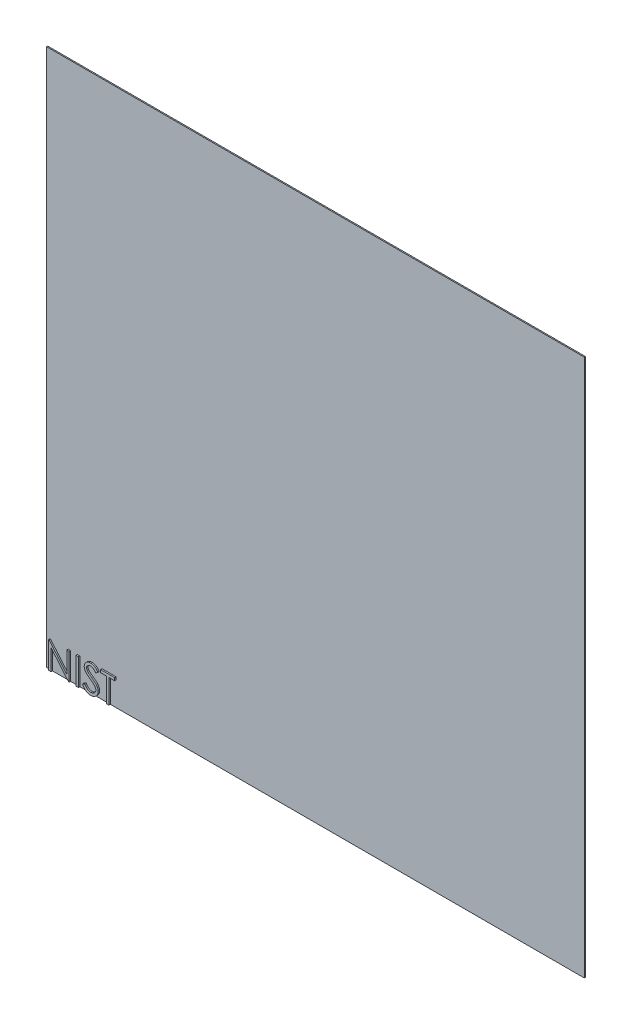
ISO-10303-21;
HEADER;
FILE_DESCRIPTION(('STEP AP214'),'2;1');
FILE_NAME('part.step','',(''),(''),'','','');
FILE_SCHEMA(('AUTOMOTIVE_DESIGN { 1 0 10303 214 1 1 1 1 }'));
ENDSEC;
DATA;
#1=APPLICATION_CONTEXT('core data for automotive mechanical design processes');
#2=APPLICATION_PROTOCOL_DEFINITION('international standard','automotive_design',2000,#1);
#3=PRODUCT_CONTEXT('',#1,'mechanical');
#4=PRODUCT('Part','Part','',(#3));
#5=PRODUCT_RELATED_PRODUCT_CATEGORY('part','',(#4));
#6=PRODUCT_DEFINITION_FORMATION('','',#4);
#7=PRODUCT_DEFINITION_CONTEXT('part definition',#1,'design');
#8=PRODUCT_DEFINITION('design','',#6,#7);
#9=PRODUCT_DEFINITION_SHAPE('','',#8);
#10=(LENGTH_UNIT() NAMED_UNIT(*) SI_UNIT(.MILLI.,.METRE.));
#11=(NAMED_UNIT(*) PLANE_ANGLE_UNIT() SI_UNIT($,.RADIAN.));
#12=(NAMED_UNIT(*) SI_UNIT($,.STERADIAN.) SOLID_ANGLE_UNIT());
#13=UNCERTAINTY_MEASURE_WITH_UNIT(LENGTH_MEASURE(1.E-05),#10,'distance_accuracy_value','');
#14=(GEOMETRIC_REPRESENTATION_CONTEXT(3) GLOBAL_UNCERTAINTY_ASSIGNED_CONTEXT((#13)) GLOBAL_UNIT_ASSIGNED_CONTEXT((#10,
#11,#12)) REPRESENTATION_CONTEXT('',''));
#15=CARTESIAN_POINT('',(0.,0.,0.));
#16=DIRECTION('',(0.,0.,1.));
#17=DIRECTION('',(1.,0.,0.));
#18=AXIS2_PLACEMENT_3D('',#15,#16,#17);
#19=CARTESIAN_POINT('',(0.,0.,0.79375));
#20=DIRECTION('',(0.,0.,-1.));
#21=DIRECTION('',(-1.,0.,0.));
#22=AXIS2_PLACEMENT_3D('',#19,#20,#21);
#23=PLANE('',#22);
#24=DIRECTION('',(1.,0.,0.));
#25=VECTOR('',#24,1.);
#26=CARTESIAN_POINT('',(0.,0.,0.79375));
#27=LINE('',#26,#25);
#28=CARTESIAN_POINT('',(34.7546689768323,-5.81832555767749E-11,0.79375));
#29=VERTEX_POINT('',#28);
#30=CARTESIAN_POINT('',(43.7173076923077,0.,0.79375));
#31=VERTEX_POINT('',#30);
#32=EDGE_CURVE('E515',#29,#31,#27,.T.);
#33=ORIENTED_EDGE('',*,*,#32,.T.);
#34=DIRECTION('',(0.,1.,0.));
#35=VECTOR('',#34,1.);
#36=CARTESIAN_POINT('',(43.7173076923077,0.,0.79375));
#37=LINE('',#36,#35);
#38=CARTESIAN_POINT('',(43.7173076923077,17.0961538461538,0.79375));
#39=VERTEX_POINT('',#38);
#40=EDGE_CURVE('E55',#31,#39,#37,.T.);
#41=ORIENTED_EDGE('',*,*,#40,.T.);
#42=DIRECTION('',(-1.,0.,0.));
#43=VECTOR('',#42,1.);
#44=CARTESIAN_POINT('',(43.7173076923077,17.0961538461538,0.79375));
#45=LINE('',#44,#43);
#46=CARTESIAN_POINT('',(39.5653846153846,17.0961538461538,0.79375));
#47=VERTEX_POINT('',#46);
#48=EDGE_CURVE('E375',#39,#47,#45,.T.);
#49=ORIENTED_EDGE('',*,*,#48,.T.);
#50=DIRECTION('',(0.,1.,0.));
#51=VECTOR('',#50,1.);
#52=CARTESIAN_POINT('',(39.5653846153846,17.0961538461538,0.79375));
#53=LINE('',#52,#51);
#54=CARTESIAN_POINT('',(39.5653846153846,19.05,0.79375));
#55=VERTEX_POINT('',#54);
#56=EDGE_CURVE('E327',#47,#55,#53,.T.);
#57=ORIENTED_EDGE('',*,*,#56,.T.);
#58=DIRECTION('',(1.,0.,0.));
#59=VECTOR('',#58,1.);
#60=CARTESIAN_POINT('',(39.5653846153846,19.05,0.79375));
#61=LINE('',#60,#59);
#62=CARTESIAN_POINT('',(49.5788461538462,19.05,0.79375));
#63=VERTEX_POINT('',#62);
#64=EDGE_CURVE('E380',#55,#63,#61,.T.);
#65=ORIENTED_EDGE('',*,*,#64,.T.);
#66=DIRECTION('',(0.,-1.,0.));
#67=VECTOR('',#66,1.);
#68=CARTESIAN_POINT('',(49.5788461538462,19.05,0.79375));
#69=LINE('',#68,#67);
#70=CARTESIAN_POINT('',(49.5788461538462,17.0961538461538,0.79375));
#71=VERTEX_POINT('',#70);
#72=EDGE_CURVE('E383',#63,#71,#69,.T.);
#73=ORIENTED_EDGE('',*,*,#72,.T.);
#74=DIRECTION('',(-1.,0.,0.));
#75=VECTOR('',#74,1.);
#76=CARTESIAN_POINT('',(49.5788461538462,17.0961538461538,0.79375));
#77=LINE('',#76,#75);
#78=CARTESIAN_POINT('',(45.4269230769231,17.0961538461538,0.79375));
#79=VERTEX_POINT('',#78);
#80=EDGE_CURVE('E62',#71,#79,#77,.T.);
#81=ORIENTED_EDGE('',*,*,#80,.T.);
#82=DIRECTION('',(0.,-1.,0.));
#83=VECTOR('',#82,1.);
#84=CARTESIAN_POINT('',(45.4269230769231,17.0961538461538,0.79375));
#85=LINE('',#84,#83);
#86=CARTESIAN_POINT('',(45.4269230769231,0.,0.79375));
#87=VERTEX_POINT('',#86);
#88=EDGE_CURVE('E352',#79,#87,#85,.T.);
#89=ORIENTED_EDGE('',*,*,#88,.T.);
#90=CARTESIAN_POINT('',(383.54,0.,0.79375));
#91=VERTEX_POINT('',#90);
#92=EDGE_CURVE('E520',#87,#91,#27,.T.);
#93=ORIENTED_EDGE('',*,*,#92,.T.);
#94=DIRECTION('',(0.,1.,0.));
#95=VECTOR('',#94,1.);
#96=CARTESIAN_POINT('',(383.54,0.,0.79375));
#97=LINE('',#96,#95);
#98=CARTESIAN_POINT('',(383.54,383.54,0.79375));
#99=VERTEX_POINT('',#98);
#100=EDGE_CURVE('E540',#91,#99,#97,.T.);
#101=ORIENTED_EDGE('',*,*,#100,.T.);
#102=DIRECTION('',(-1.,0.,0.));
#103=VECTOR('',#102,1.);
#104=CARTESIAN_POINT('',(0.,383.54,0.79375));
#105=LINE('',#104,#103);
#106=CARTESIAN_POINT('',(0.,383.54,0.79375));
#107=VERTEX_POINT('',#106);
#108=EDGE_CURVE('E553',#99,#107,#105,.T.);
#109=ORIENTED_EDGE('',*,*,#108,.T.);
#110=DIRECTION('',(0.,-1.,0.));
#111=VECTOR('',#110,1.);
#112=CARTESIAN_POINT('',(0.,0.,0.79375));
#113=LINE('',#112,#111);
#114=CARTESIAN_POINT('',(0.,0.,0.79375));
#115=VERTEX_POINT('',#114);
#116=EDGE_CURVE('E543',#107,#115,#113,.T.);
#117=ORIENTED_EDGE('',*,*,#116,.T.);
#118=CARTESIAN_POINT('',(2.44230769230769,0.,0.79375));
#119=VERTEX_POINT('',#118);
#120=EDGE_CURVE('E544',#115,#119,#27,.T.);
#121=ORIENTED_EDGE('',*,*,#120,.T.);
#122=DIRECTION('',(0.,1.,0.));
#123=VECTOR('',#122,1.);
#124=CARTESIAN_POINT('',(2.44230769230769,0.,0.79375));
#125=LINE('',#124,#123);
#126=CARTESIAN_POINT('',(2.44230769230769,19.05,0.79375));
#127=VERTEX_POINT('',#126);
#128=EDGE_CURVE('E647',#119,#127,#125,.T.);
#129=ORIENTED_EDGE('',*,*,#128,.T.);
#130=DIRECTION('',(1.,0.,0.));
#131=VECTOR('',#130,1.);
#132=CARTESIAN_POINT('',(2.44230769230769,19.05,0.79375));
#133=LINE('',#132,#131);
#134=CARTESIAN_POINT('',(2.80102163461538,19.05,0.79375));
#135=VERTEX_POINT('',#134);
#136=EDGE_CURVE('E643',#127,#135,#133,.T.);
#137=ORIENTED_EDGE('',*,*,#136,.T.);
#138=DIRECTION('',(0.642922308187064,-0.76593139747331,0.));
#139=VECTOR('',#138,1.);
#140=CARTESIAN_POINT('',(2.80102163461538,19.05,0.79375));
#141=LINE('',#140,#139);
#142=CARTESIAN_POINT('',(15.3865384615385,4.05652043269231,0.79375));
#143=VERTEX_POINT('',#142);
#144=EDGE_CURVE('E639',#135,#143,#141,.T.);
#145=ORIENTED_EDGE('',*,*,#144,.T.);
#146=DIRECTION('',(0.,1.,0.));
#147=VECTOR('',#146,1.);
#148=CARTESIAN_POINT('',(15.3865384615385,4.05652043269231,0.79375));
#149=LINE('',#148,#147);
#150=CARTESIAN_POINT('',(15.3865384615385,19.05,0.79375));
#151=VERTEX_POINT('',#150);
#152=EDGE_CURVE('E635',#143,#151,#149,.T.);
#153=ORIENTED_EDGE('',*,*,#152,.T.);
#154=DIRECTION('',(1.,0.,0.));
#155=VECTOR('',#154,1.);
#156=CARTESIAN_POINT('',(15.3865384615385,19.05,0.79375));
#157=LINE('',#156,#155);
#158=CARTESIAN_POINT('',(17.0961538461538,19.05,0.79375));
#159=VERTEX_POINT('',#158);
#160=EDGE_CURVE('E631',#151,#159,#157,.T.);
#161=ORIENTED_EDGE('',*,*,#160,.T.);
#162=DIRECTION('',(0.,-1.,0.));
#163=VECTOR('',#162,1.);
#164=CARTESIAN_POINT('',(17.0961538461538,19.05,0.79375));
#165=LINE('',#164,#163);
#166=CARTESIAN_POINT('',(17.0961538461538,0.,0.79375));
#167=VERTEX_POINT('',#166);
#168=EDGE_CURVE('E627',#159,#167,#165,.T.);
#169=ORIENTED_EDGE('',*,*,#168,.T.);
#170=CARTESIAN_POINT('',(21.9807692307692,0.,0.79375));
#171=VERTEX_POINT('',#170);
#172=EDGE_CURVE('E1469',#167,#171,#27,.T.);
#173=ORIENTED_EDGE('',*,*,#172,.T.);
#174=DIRECTION('',(0.,1.,0.));
#175=VECTOR('',#174,1.);
#176=CARTESIAN_POINT('',(21.9807692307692,0.,0.79375));
#177=LINE('',#176,#175);
#178=CARTESIAN_POINT('',(21.9807692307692,19.05,0.79375));
#179=VERTEX_POINT('',#178);
#180=EDGE_CURVE('E714',#171,#179,#177,.T.);
#181=ORIENTED_EDGE('',*,*,#180,.T.);
#182=DIRECTION('',(1.,0.,0.));
#183=VECTOR('',#182,1.);
#184=CARTESIAN_POINT('',(21.9807692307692,19.05,0.79375));
#185=LINE('',#184,#183);
#186=CARTESIAN_POINT('',(23.6903846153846,19.05,0.79375));
#187=VERTEX_POINT('',#186);
#188=EDGE_CURVE('E711',#179,#187,#185,.T.);
#189=ORIENTED_EDGE('',*,*,#188,.T.);
#190=DIRECTION('',(0.,-1.,0.));
#191=VECTOR('',#190,1.);
#192=CARTESIAN_POINT('',(23.6903846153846,19.05,0.79375));
#193=LINE('',#192,#191);
#194=CARTESIAN_POINT('',(23.6903846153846,0.,0.79375));
#195=VERTEX_POINT('',#194);
#196=EDGE_CURVE('E706',#187,#195,#193,.T.);
#197=ORIENTED_EDGE('',*,*,#196,.T.);
#198=CARTESIAN_POINT('',(30.0823770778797,0.,0.79375));
#199=VERTEX_POINT('',#198);
#200=EDGE_CURVE('E1467',#195,#199,#27,.T.);
#201=ORIENTED_EDGE('',*,*,#200,.T.);
#202=CARTESIAN_POINT('',(32.4140024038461,-0.488461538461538,0.79375));
#203=CARTESIAN_POINT('',(32.2701186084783,-0.48567925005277,0.79375));
#204=CARTESIAN_POINT('',(31.9841630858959,-0.480149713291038,0.79375));
#205=CARTESIAN_POINT('',(31.5612014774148,-0.431265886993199,0.79375));
#206=CARTESIAN_POINT('',(31.1467845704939,-0.36210293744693,0.79375));
#207=CARTESIAN_POINT('',(30.7461125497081,-0.252298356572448,0.79375));
#208=CARTESIAN_POINT('',(30.3540232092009,-0.119073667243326,0.79375));
#209=CARTESIAN_POINT('',(29.9722218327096,0.0449649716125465,0.79375));
#210=CARTESIAN_POINT('',(29.6005233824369,0.241545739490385,0.79375));
#211=CARTESIAN_POINT('',(29.2368448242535,0.466308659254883,0.79375));
#212=CARTESIAN_POINT('',(28.8821111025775,0.727880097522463,0.79375));
#213=CARTESIAN_POINT('',(28.5396494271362,1.03253584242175,0.79375));
#214=CARTESIAN_POINT('',(28.1982234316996,1.37187351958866,0.79375));
#215=CARTESIAN_POINT('',(27.8679106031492,1.75510815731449,0.79375));
#216=CARTESIAN_POINT('',(27.5420296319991,2.17604829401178,0.79375));
#217=CARTESIAN_POINT('',(27.2270057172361,2.63863227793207,0.79375));
#218=CARTESIAN_POINT('',(26.9163180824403,3.14034044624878,0.79375));
#219=CARTESIAN_POINT('',(26.7213796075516,3.49339184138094,0.79375));
#220=CARTESIAN_POINT('',(26.6211538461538,3.67490985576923,0.79375));
#221=B_SPLINE_CURVE_WITH_KNOTS('',3,(#202,#203,#204,#205,#206,#207,#208,#209,#210,#211,#212,
#213,#214,#215,#216,#217,#218,#219,#220),.UNSPECIFIED.,.F.,.F.,(4,1,1,1,1,1,1,1,1,1,1,1,1,1,1,1,
4),(0.,0.0572082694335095,0.11369605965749,0.169177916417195,0.224159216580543,
0.278719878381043,0.333794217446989,0.389241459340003,0.445822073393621,0.50370428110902,
0.564293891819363,0.627975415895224,0.695038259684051,0.765372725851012,0.839611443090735,
0.917537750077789,1.),.UNSPECIFIED.);
#222=CARTESIAN_POINT('',(26.6211538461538,3.67490985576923,0.79375));
#223=VERTEX_POINT('',#222);
#224=EDGE_CURVE('E392',#199,#223,#221,.T.);
#225=ORIENTED_EDGE('',*,*,#224,.T.);
#226=DIRECTION('',(0.857672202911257,0.514196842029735,0.));
#227=VECTOR('',#226,1.);
#228=CARTESIAN_POINT('',(26.6211538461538,3.67490985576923,0.79375));
#229=LINE('',#228,#227);
#230=CARTESIAN_POINT('',(28.2315504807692,4.64038461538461,0.79375));
#231=VERTEX_POINT('',#230);
#232=EDGE_CURVE('E912',#223,#231,#229,.T.);
#233=ORIENTED_EDGE('',*,*,#232,.T.);
#234=CARTESIAN_POINT('',(28.2315504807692,4.64038461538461,0.79375));
#235=CARTESIAN_POINT('',(28.3813283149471,4.38966274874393,0.79375));
#236=CARTESIAN_POINT('',(28.6682968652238,3.90928932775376,0.79375));
#237=CARTESIAN_POINT('',(29.1470035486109,3.26018485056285,0.79375));
#238=CARTESIAN_POINT('',(29.6430269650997,2.70848511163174,0.79375));
#239=CARTESIAN_POINT('',(30.1600403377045,2.25739957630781,0.79375));
#240=CARTESIAN_POINT('',(30.694887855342,1.90225920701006,0.79375));
#241=CARTESIAN_POINT('',(31.2510610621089,1.65078706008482,0.79375));
#242=CARTESIAN_POINT('',(31.8266857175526,1.49394582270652,0.79375));
#243=CARTESIAN_POINT('',(32.2184289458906,1.47489535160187,0.79375));
#244=CARTESIAN_POINT('',(32.4140024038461,1.46538461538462,0.79375));
#245=B_SPLINE_CURVE_WITH_KNOTS('',3,(#234,#235,#236,#237,#238,#239,#240,#241,#242,#243,#244),
.UNSPECIFIED.,.F.,.F.,(4,1,1,1,1,1,1,1,4),(0.,0.159004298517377,0.304646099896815,
0.438546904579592,0.562322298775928,0.677432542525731,0.786897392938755,0.893610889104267,1.),.UNSPECIFIED.);
#246=CARTESIAN_POINT('',(32.4140024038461,1.46538461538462,0.79375));
#247=VERTEX_POINT('',#246);
#248=EDGE_CURVE('E904',#231,#247,#245,.T.);
#249=ORIENTED_EDGE('',*,*,#248,.T.);
#250=CARTESIAN_POINT('',(32.4140024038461,1.46538461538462,0.79375));
#251=CARTESIAN_POINT('',(32.581026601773,1.47003647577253,0.79375));
#252=CARTESIAN_POINT('',(32.9121524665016,1.47925879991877,0.79375));
#253=CARTESIAN_POINT('',(33.3996269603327,1.56787287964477,0.79375));
#254=CARTESIAN_POINT('',(33.8730564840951,1.70401032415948,0.79375));
#255=CARTESIAN_POINT('',(34.3226834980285,1.89897853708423,0.79375));
#256=CARTESIAN_POINT('',(34.7423039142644,2.13486372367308,0.79375));
#257=CARTESIAN_POINT('',(35.1102774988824,2.41977648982,0.79375));
#258=CARTESIAN_POINT('',(35.4283913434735,2.73876169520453,0.79375));
#259=CARTESIAN_POINT('',(35.688609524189,3.09463014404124,0.79375));
#260=CARTESIAN_POINT('',(35.8882537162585,3.47735633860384,0.79375));
#261=CARTESIAN_POINT('',(36.0416991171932,3.87019973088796,0.79375));
#262=CARTESIAN_POINT('',(36.1268530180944,4.2793315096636,0.79375));
#263=CARTESIAN_POINT('',(36.1396804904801,4.55479702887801,0.79375));
#264=CARTESIAN_POINT('',(36.1461538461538,4.69381009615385,0.79375));
#265=B_SPLINE_CURVE_WITH_KNOTS('',3,(#250,#251,#252,#253,#254,#255,#256,#257,#258,#259,#260,
#261,#262,#263,#264),.UNSPECIFIED.,.F.,.F.,(4,1,1,1,1,1,1,1,1,1,1,1,4),(0.,0.0912636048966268,
0.180930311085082,0.270088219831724,0.360156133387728,0.448342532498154,0.532665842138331,
0.613833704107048,0.693981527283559,0.772715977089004,0.849335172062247,0.923967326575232,1.),.UNSPECIFIED.);
#266=CARTESIAN_POINT('',(36.1461538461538,4.69381009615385,0.79375));
#267=VERTEX_POINT('',#266);
#268=EDGE_CURVE('E896',#247,#267,#265,.T.);
#269=ORIENTED_EDGE('',*,*,#268,.T.);
#270=CARTESIAN_POINT('',(36.1461538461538,4.69381009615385,0.79375));
#271=CARTESIAN_POINT('',(36.1381293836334,4.85241957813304,0.79375));
#272=CARTESIAN_POINT('',(36.1218168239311,5.17484947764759,0.79375));
#273=CARTESIAN_POINT('',(35.9839411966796,5.65055330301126,0.79375));
#274=CARTESIAN_POINT('',(35.7670474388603,6.12132000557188,0.79375));
#275=CARTESIAN_POINT('',(35.5669536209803,6.41251975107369,0.79375));
#276=CARTESIAN_POINT('',(35.4630709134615,6.56370192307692,0.79375));
#277=B_SPLINE_CURVE_WITH_KNOTS('',3,(#270,#271,#272,#273,#274,#275,#276),.UNSPECIFIED.,.F.,.F.,
(4,1,1,1,4),(0.,0.234723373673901,0.477158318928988,0.728556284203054,1.),.UNSPECIFIED.);
#278=CARTESIAN_POINT('',(35.4630709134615,6.56370192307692,0.79375));
#279=VERTEX_POINT('',#278);
#280=EDGE_CURVE('E888',#267,#279,#277,.T.);
#281=ORIENTED_EDGE('',*,*,#280,.T.);
#282=CARTESIAN_POINT('',(35.4630709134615,6.56370192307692,0.79375));
#283=CARTESIAN_POINT('',(35.3777779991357,6.67281392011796,0.79375));
#284=CARTESIAN_POINT('',(35.1987161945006,6.90188090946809,0.79375));
#285=CARTESIAN_POINT('',(34.8908817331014,7.24284997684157,0.79375));
#286=CARTESIAN_POINT('',(34.5296604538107,7.59455879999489,0.79375));
#287=CARTESIAN_POINT('',(34.1274139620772,7.97043738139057,0.79375));
#288=CARTESIAN_POINT('',(33.6694895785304,8.35300381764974,0.79375));
#289=CARTESIAN_POINT('',(33.1702298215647,8.76050115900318,0.79375));
#290=CARTESIAN_POINT('',(32.6168879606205,9.1774325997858,0.79375));
#291=CARTESIAN_POINT('',(32.2288149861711,9.45704613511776,0.79375));
#292=CARTESIAN_POINT('',(32.0285757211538,9.60132211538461,0.79375));
#293=B_SPLINE_CURVE_WITH_KNOTS('',3,(#282,#283,#284,#285,#286,#287,#288,#289,#290,#291,#292),
.UNSPECIFIED.,.F.,.F.,(4,1,1,1,1,1,1,1,4),(0.,0.0902792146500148,0.189529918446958,
0.299197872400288,0.41892588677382,0.548376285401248,0.688136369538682,0.83908350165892,1.),.UNSPECIFIED.);
#294=CARTESIAN_POINT('',(32.0285757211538,9.60132211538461,0.79375));
#295=VERTEX_POINT('',#294);
#296=EDGE_CURVE('E880',#279,#295,#293,.T.);
#297=ORIENTED_EDGE('',*,*,#296,.T.);
#298=CARTESIAN_POINT('',(32.0285757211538,9.60132211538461,0.79375));
#299=CARTESIAN_POINT('',(31.8281479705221,9.74408057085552,0.79375));
#300=CARTESIAN_POINT('',(31.4449453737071,10.017023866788,0.79375));
#301=CARTESIAN_POINT('',(30.9090493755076,10.4221046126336,0.79375));
#302=CARTESIAN_POINT('',(30.4298359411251,10.7924576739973,0.79375));
#303=CARTESIAN_POINT('',(30.0094350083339,11.1315695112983,0.79375));
#304=CARTESIAN_POINT('',(29.6480314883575,11.4394861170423,0.79375));
#305=CARTESIAN_POINT('',(29.3427774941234,11.7132506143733,0.79375));
#306=CARTESIAN_POINT('',(29.1014490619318,11.9602668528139,0.79375));
#307=CARTESIAN_POINT('',(28.9672522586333,12.1205118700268,0.79375));
#308=CARTESIAN_POINT('',(28.9070012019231,12.1924579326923,0.79375));
#309=B_SPLINE_CURVE_WITH_KNOTS('',3,(#298,#299,#300,#301,#302,#303,#304,#305,#306,#307,#308),
.UNSPECIFIED.,.F.,.F.,(4,1,1,1,1,1,1,1,4),(0.,0.181535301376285,0.347081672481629,
0.495567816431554,0.628357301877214,0.745519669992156,0.845830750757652,0.930781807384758,1.),.UNSPECIFIED.);
#310=CARTESIAN_POINT('',(28.9070012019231,12.1924579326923,0.79375));
#311=VERTEX_POINT('',#310);
#312=EDGE_CURVE('E872',#295,#311,#309,.T.);
#313=ORIENTED_EDGE('',*,*,#312,.T.);
#314=CARTESIAN_POINT('',(28.9070012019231,12.1924579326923,0.79375));
#315=CARTESIAN_POINT('',(28.8227863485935,12.3045864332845,0.79375));
#316=CARTESIAN_POINT('',(28.6571665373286,12.5251021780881,0.79375));
#317=CARTESIAN_POINT('',(28.4385487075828,12.8697703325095,0.79375));
#318=CARTESIAN_POINT('',(28.2527341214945,13.2225941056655,0.79375));
#319=CARTESIAN_POINT('',(28.1070705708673,13.5845215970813,0.79375));
#320=CARTESIAN_POINT('',(27.9844091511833,13.9504717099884,0.79375));
#321=CARTESIAN_POINT('',(27.9019066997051,14.3252192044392,0.79375));
#322=CARTESIAN_POINT('',(27.8502463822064,14.7070825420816,0.79375));
#323=CARTESIAN_POINT('',(27.8449559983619,14.9640588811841,0.79375));
#324=CARTESIAN_POINT('',(27.8423076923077,15.0926983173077,0.79375));
#325=B_SPLINE_CURVE_WITH_KNOTS('',3,(#314,#315,#316,#317,#318,#319,#320,#321,#322,#323,#324),
.UNSPECIFIED.,.F.,.F.,(4,1,1,1,1,1,1,1,4),(0.,0.133506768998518,0.26255897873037,
0.388264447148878,0.512667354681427,0.63372226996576,0.755393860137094,0.877552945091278,1.),.UNSPECIFIED.);
#326=CARTESIAN_POINT('',(27.8423076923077,15.0926983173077,0.79375));
#327=VERTEX_POINT('',#326);
#328=EDGE_CURVE('E864',#311,#327,#325,.T.);
#329=ORIENTED_EDGE('',*,*,#328,.T.);
#330=CARTESIAN_POINT('',(27.8423076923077,15.0926983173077,0.79375));
#331=CARTESIAN_POINT('',(27.8494117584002,15.2942460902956,0.79375));
#332=CARTESIAN_POINT('',(27.8634680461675,15.6930336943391,0.79375));
#333=CARTESIAN_POINT('',(27.9823428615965,16.2755872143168,0.79375));
#334=CARTESIAN_POINT('',(28.1699738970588,16.8317732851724,0.79375));
#335=CARTESIAN_POINT('',(28.4328360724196,17.3560855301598,0.79375));
#336=CARTESIAN_POINT('',(28.771693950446,17.8348717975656,0.79375));
#337=CARTESIAN_POINT('',(29.1638298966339,18.2736394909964,0.79375));
#338=CARTESIAN_POINT('',(29.6308895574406,18.6424942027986,0.79375));
#339=CARTESIAN_POINT('',(30.1433488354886,18.9647769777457,0.79375));
#340=CARTESIAN_POINT('',(30.7042699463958,19.2170312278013,0.79375));
#341=CARTESIAN_POINT('',(31.2920490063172,19.4073188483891,0.79375));
#342=CARTESIAN_POINT('',(31.9076202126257,19.515137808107,0.79375));
#343=CARTESIAN_POINT('',(32.324560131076,19.5306105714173,0.79375));
#344=CARTESIAN_POINT('',(32.5361177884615,19.5384615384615,0.79375));
#345=B_SPLINE_CURVE_WITH_KNOTS('',3,(#330,#331,#332,#333,#334,#335,#336,#337,#338,#339,#340,
#341,#342,#343,#344),.UNSPECIFIED.,.F.,.F.,(4,1,1,1,1,1,1,1,1,1,1,1,4),(0.,0.0837853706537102,
0.165779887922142,0.246280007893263,0.32746092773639,0.408796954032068,0.489715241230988,
0.571376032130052,0.655523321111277,0.741019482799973,0.82654676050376,0.911988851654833,1.),.UNSPECIFIED.);
#346=CARTESIAN_POINT('',(32.5361177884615,19.5384615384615,0.79375));
#347=VERTEX_POINT('',#346);
#348=EDGE_CURVE('E856',#327,#347,#345,.T.);
#349=ORIENTED_EDGE('',*,*,#348,.T.);
#350=CARTESIAN_POINT('',(32.5361177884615,19.5384615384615,0.79375));
#351=CARTESIAN_POINT('',(32.7606035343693,19.5307187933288,0.79375));
#352=CARTESIAN_POINT('',(33.2070340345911,19.5153209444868,0.79375));
#353=CARTESIAN_POINT('',(33.863710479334,19.3814400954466,0.79375));
#354=CARTESIAN_POINT('',(34.4959566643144,19.1599121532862,0.79375));
#355=CARTESIAN_POINT('',(35.0045550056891,18.908513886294,0.79375));
#356=CARTESIAN_POINT('',(35.4026061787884,18.657427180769,0.79375));
#357=CARTESIAN_POINT('',(35.706169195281,18.4287192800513,0.79375));
#358=CARTESIAN_POINT('',(36.0137856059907,18.1654204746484,0.79375));
#359=CARTESIAN_POINT('',(36.3279367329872,17.8668294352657,0.79375));
#360=CARTESIAN_POINT('',(36.6432994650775,17.5302064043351,0.79375));
#361=CARTESIAN_POINT('',(36.9645556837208,17.1578567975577,0.79375));
#362=CARTESIAN_POINT('',(37.2924566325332,16.7520561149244,0.79375));
#363=CARTESIAN_POINT('',(37.5033992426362,16.4623627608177,0.79375));
#364=CARTESIAN_POINT('',(37.6115384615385,16.3138521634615,0.79375));
#365=B_SPLINE_CURVE_WITH_KNOTS('',3,(#350,#351,#352,#353,#354,#355,#356,#357,#358,#359,#360,
#361,#362,#363,#364),.UNSPECIFIED.,.F.,.F.,(4,1,1,1,1,1,1,1,1,1,1,1,4),(0.,0.107232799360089,
0.213251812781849,0.318830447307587,0.426793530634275,0.483645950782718,0.543603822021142,
0.608307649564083,0.67712676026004,0.750685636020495,0.828713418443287,0.912190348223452,1.),.UNSPECIFIED.);
#366=CARTESIAN_POINT('',(37.6115384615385,16.3138521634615,0.79375));
#367=VERTEX_POINT('',#366);
#368=EDGE_CURVE('E851',#347,#367,#365,.T.);
#369=ORIENTED_EDGE('',*,*,#368,.T.);
#370=DIRECTION('',(-0.796919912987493,-0.604084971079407,0.));
#371=VECTOR('',#370,1.);
#372=CARTESIAN_POINT('',(37.6115384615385,16.3138521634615,0.79375));
#373=LINE('',#372,#371);
#374=CARTESIAN_POINT('',(36.066015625,15.1423076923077,0.79375));
#375=VERTEX_POINT('',#374);
#376=EDGE_CURVE('E845',#367,#375,#373,.T.);
#377=ORIENTED_EDGE('',*,*,#376,.T.);
#378=CARTESIAN_POINT('',(36.066015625,15.1423076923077,0.79375));
#379=CARTESIAN_POINT('',(35.9726927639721,15.2625332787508,0.79375));
#380=CARTESIAN_POINT('',(35.7929747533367,15.4940596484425,0.79375));
#381=CARTESIAN_POINT('',(35.5201271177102,15.8182978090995,0.79375));
#382=CARTESIAN_POINT('',(35.262959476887,16.114478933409,0.79375));
#383=CARTESIAN_POINT('',(35.0095923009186,16.3717362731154,0.79375));
#384=CARTESIAN_POINT('',(34.7734069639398,16.6041578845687,0.79375));
#385=CARTESIAN_POINT('',(34.5441699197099,16.8031474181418,0.79375));
#386=CARTESIAN_POINT('',(34.3251800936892,16.9706545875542,0.79375));
#387=CARTESIAN_POINT('',(34.0491351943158,17.1494173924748,0.79375));
#388=CARTESIAN_POINT('',(33.7023287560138,17.3266177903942,0.79375));
#389=CARTESIAN_POINT('',(33.2669843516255,17.4765634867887,0.79375));
#390=CARTESIAN_POINT('',(32.8120361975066,17.5666703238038,0.79375));
#391=CARTESIAN_POINT('',(32.5021763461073,17.5785841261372,0.79375));
#392=CARTESIAN_POINT('',(32.3453125,17.5846153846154,0.79375));
#393=B_SPLINE_CURVE_WITH_KNOTS('',3,(#378,#379,#380,#381,#382,#383,#384,#385,#386,#387,#388,
#389,#390,#391,#392),.UNSPECIFIED.,.F.,.F.,(4,1,1,1,1,1,1,1,1,1,1,1,4),(0.,0.0984694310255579,
0.189629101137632,0.27418408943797,0.352183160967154,0.423198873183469,0.488550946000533,
0.548473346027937,0.601440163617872,0.701198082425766,0.799591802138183,0.898545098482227,1.),.UNSPECIFIED.);
#394=CARTESIAN_POINT('',(32.3453125,17.5846153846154,0.79375));
#395=VERTEX_POINT('',#394);
#396=EDGE_CURVE('E837',#375,#395,#393,.T.);
#397=ORIENTED_EDGE('',*,*,#396,.T.);
#398=CARTESIAN_POINT('',(32.3453125,17.5846153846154,0.79375));
#399=CARTESIAN_POINT('',(32.1485177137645,17.5780202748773,0.79375));
#400=CARTESIAN_POINT('',(31.7690175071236,17.5653022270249,0.79375));
#401=CARTESIAN_POINT('',(31.2302277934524,17.4264005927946,0.79375));
#402=CARTESIAN_POINT('',(30.7453022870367,17.2076964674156,0.79375));
#403=CARTESIAN_POINT('',(30.3286376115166,16.9011820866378,0.79375));
#404=CARTESIAN_POINT('',(29.9817263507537,16.5380292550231,0.79375));
#405=CARTESIAN_POINT('',(29.7307809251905,16.1201329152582,0.79375));
#406=CARTESIAN_POINT('',(29.5797407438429,15.6586744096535,0.79375));
#407=CARTESIAN_POINT('',(29.5613097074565,15.336774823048,0.79375));
#408=CARTESIAN_POINT('',(29.5519230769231,15.1728365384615,0.79375));
#409=B_SPLINE_CURVE_WITH_KNOTS('',3,(#398,#399,#400,#401,#402,#403,#404,#405,#406,#407,#408),
.UNSPECIFIED.,.F.,.F.,(4,1,1,1,1,1,1,1,4),(0.,0.143073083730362,0.275902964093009,
0.402370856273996,0.528413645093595,0.650356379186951,0.765895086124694,0.880774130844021,1.),.UNSPECIFIED.);
#410=CARTESIAN_POINT('',(29.5519230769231,15.1728365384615,0.79375));
#411=VERTEX_POINT('',#410);
#412=EDGE_CURVE('E829',#395,#411,#409,.T.);
#413=ORIENTED_EDGE('',*,*,#412,.T.);
#414=CARTESIAN_POINT('',(29.5519230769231,15.1728365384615,0.79375));
#415=CARTESIAN_POINT('',(29.5540628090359,15.0707749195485,0.79375));
#416=CARTESIAN_POINT('',(29.5583457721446,14.8664847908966,0.79375));
#417=CARTESIAN_POINT('',(29.6180800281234,14.564670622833,0.79375));
#418=CARTESIAN_POINT('',(29.694820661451,14.2636189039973,0.79375));
#419=CARTESIAN_POINT('',(29.8164284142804,13.9646831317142,0.79375));
#420=CARTESIAN_POINT('',(29.9843149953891,13.6626352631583,0.79375));
#421=CARTESIAN_POINT('',(30.2047788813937,13.3522740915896,0.79375));
#422=CARTESIAN_POINT('',(30.4824370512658,13.0308640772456,0.79375));
#423=CARTESIAN_POINT('',(30.6951276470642,12.8218182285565,0.79375));
#424=CARTESIAN_POINT('',(30.807421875,12.7114483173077,0.79375));
#425=B_SPLINE_CURVE_WITH_KNOTS('',3,(#414,#415,#416,#417,#418,#419,#420,#421,#422,#423,#424),
.UNSPECIFIED.,.F.,.F.,(4,1,1,1,1,1,1,1,4),(0.,0.107285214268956,0.21474586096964,
0.322938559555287,0.434116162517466,0.553412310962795,0.686072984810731,0.834255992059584,1.),.UNSPECIFIED.);
#426=CARTESIAN_POINT('',(30.807421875,12.7114483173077,0.79375));
#427=VERTEX_POINT('',#426);
#428=EDGE_CURVE('E821',#411,#427,#425,.T.);
#429=ORIENTED_EDGE('',*,*,#428,.T.);
#430=CARTESIAN_POINT('',(30.807421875,12.7114483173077,0.79375));
#431=CARTESIAN_POINT('',(30.8491216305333,12.6742353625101,0.79375));
#432=CARTESIAN_POINT('',(30.9481907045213,12.5858259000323,0.79375));
#433=CARTESIAN_POINT('',(31.1293068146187,12.4410879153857,0.79375));
#434=CARTESIAN_POINT('',(31.3684811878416,12.2625471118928,0.79375));
#435=CARTESIAN_POINT('',(31.6594683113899,12.0416361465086,0.79375));
#436=CARTESIAN_POINT('',(32.0076335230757,11.7853784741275,0.79375));
#437=CARTESIAN_POINT('',(32.4130151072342,11.4970506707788,0.79375));
#438=CARTESIAN_POINT('',(32.8710943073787,11.1672926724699,0.79375));
#439=CARTESIAN_POINT('',(33.1961521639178,10.9367466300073,0.79375));
#440=CARTESIAN_POINT('',(33.3680288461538,10.81484375,0.79375));
#441=B_SPLINE_CURVE_WITH_KNOTS('',3,(#430,#431,#432,#433,#434,#435,#436,#437,#438,#439,#440),
.UNSPECIFIED.,.F.,.F.,(4,1,1,1,1,1,1,1,4),(0.,0.0525942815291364,0.124951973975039,
0.218093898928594,0.333502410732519,0.468789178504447,0.624937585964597,0.801683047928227,1.),.UNSPECIFIED.);
#442=CARTESIAN_POINT('',(33.3680288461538,10.81484375,0.79375));
#443=VERTEX_POINT('',#442);
#444=EDGE_CURVE('E813',#427,#443,#441,.T.);
#445=ORIENTED_EDGE('',*,*,#444,.T.);
#446=CARTESIAN_POINT('',(33.3680288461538,10.81484375,0.79375));
#447=CARTESIAN_POINT('',(33.5747807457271,10.6643957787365,0.79375));
#448=CARTESIAN_POINT('',(33.9751271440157,10.3730741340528,0.79375));
#449=CARTESIAN_POINT('',(34.5447634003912,9.93538307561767,0.79375));
#450=CARTESIAN_POINT('',(35.0612568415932,9.50731450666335,0.79375));
#451=CARTESIAN_POINT('',(35.5264208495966,9.09160210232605,0.79375));
#452=CARTESIAN_POINT('',(35.9448508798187,8.6913991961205,0.79375));
#453=CARTESIAN_POINT('',(36.3119047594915,8.30189102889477,0.79375));
#454=CARTESIAN_POINT('',(36.6313225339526,7.92586812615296,0.79375));
#455=CARTESIAN_POINT('',(36.9751979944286,7.44378024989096,0.79375));
#456=CARTESIAN_POINT('',(37.3265769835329,6.85170034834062,0.79375));
#457=CARTESIAN_POINT('',(37.628337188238,6.12628593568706,0.79375));
#458=CARTESIAN_POINT('',(37.8186104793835,5.39805167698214,0.79375));
#459=CARTESIAN_POINT('',(37.843492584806,4.90859275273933,0.79375));
#460=CARTESIAN_POINT('',(37.8557692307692,4.66709735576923,0.79375));
#461=B_SPLINE_CURVE_WITH_KNOTS('',3,(#446,#447,#448,#449,#450,#451,#452,#453,#454,#455,#456,
#457,#458,#459,#460),.UNSPECIFIED.,.F.,.F.,(4,1,1,1,1,1,1,1,1,1,1,1,4),(0.,0.0969723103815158,
0.187773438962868,0.272396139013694,0.351320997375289,0.424334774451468,0.491908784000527,
0.5542332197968,0.611267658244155,0.716347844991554,0.814540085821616,0.908495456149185,1.),.UNSPECIFIED.);
#462=CARTESIAN_POINT('',(37.8557692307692,4.66709735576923,0.79375));
#463=VERTEX_POINT('',#462);
#464=EDGE_CURVE('E805',#443,#463,#461,.T.);
#465=ORIENTED_EDGE('',*,*,#464,.T.);
#466=CARTESIAN_POINT('',(37.8557692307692,4.66709735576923,0.79375));
#467=CARTESIAN_POINT('',(37.8521925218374,4.49630939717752,0.79375));
#468=CARTESIAN_POINT('',(37.8451085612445,4.15805006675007,0.793750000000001));
#469=CARTESIAN_POINT('',(37.7636784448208,3.66136171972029,0.79375));
#470=CARTESIAN_POINT('',(37.6443728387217,3.17895655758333,0.79375));
#471=CARTESIAN_POINT('',(37.4645558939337,2.71679750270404,0.79375));
#472=CARTESIAN_POINT('',(37.2450827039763,2.26642958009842,0.79375));
#473=CARTESIAN_POINT('',(36.9665921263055,1.83966657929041,0.79375));
#474=CARTESIAN_POINT('',(36.6437888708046,1.42706318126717,0.79375));
#475=CARTESIAN_POINT('',(36.2734908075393,1.0396216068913,0.79375));
#476=CARTESIAN_POINT('',(35.8682923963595,0.683951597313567,0.79375));
#477=CARTESIAN_POINT('',(35.4400282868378,0.367563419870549,0.79375));
#478=CARTESIAN_POINT('',(34.9879975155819,0.103757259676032,0.79375));
#479=CARTESIAN_POINT('',(34.5146522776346,-0.111512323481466,0.79375));
#480=CARTESIAN_POINT('',(34.0198838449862,-0.279879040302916,0.79375));
#481=CARTESIAN_POINT('',(33.5038586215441,-0.401869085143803,0.79375));
#482=CARTESIAN_POINT('',(32.9657259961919,-0.476739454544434,0.79375));
#483=CARTESIAN_POINT('',(32.5999633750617,-0.484510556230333,0.79375));
#484=CARTESIAN_POINT('',(32.4140024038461,-0.488461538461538,0.79375));
#485=B_SPLINE_CURVE_WITH_KNOTS('',3,(#466,#467,#468,#469,#470,#471,#472,#473,#474,#475,#476,
#477,#478,#479,#480,#481,#482,#483,#484),.UNSPECIFIED.,.F.,.F.,(4,1,1,1,1,1,1,1,1,1,1,1,1,1,1,1,
4),(0.,0.0614842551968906,0.12177452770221,0.180919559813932,0.240256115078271,
0.300114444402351,0.361145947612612,0.423500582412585,0.488669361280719,0.553954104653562,
0.617581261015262,0.68023842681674,0.742187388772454,0.804663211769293,0.868258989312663,
0.933020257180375,1.),.UNSPECIFIED.);
#486=EDGE_CURVE('E422',#463,#29,#485,.T.);
#487=ORIENTED_EDGE('',*,*,#486,.T.);
#488=EDGE_LOOP('',(#33,#41,#49,#57,#65,#73,#81,#89,#93,#101,#109,#117,#121,#129,#137,#145,#153,
#161,#169,#173,#181,#189,#197,#201,#225,#233,#249,#269,#281,#297,#313,#329,#349,#369,#377,#397,
#413,#429,#445,#465,#487));
#489=FACE_BOUND('',#488,.T.);
#490=ADVANCED_FACE('F39',(#489),#23,.F.);
#491=CARTESIAN_POINT('',(0.,0.,0.79375));
#492=DIRECTION('',(1.,0.,0.));
#493=DIRECTION('',(0.,0.,-1.));
#494=AXIS2_PLACEMENT_3D('',#491,#492,#493);
#495=PLANE('',#494);
#496=DIRECTION('',(0.,-1.,0.));
#497=VECTOR('',#496,1.);
#498=CARTESIAN_POINT('',(0.,0.,0.));
#499=LINE('',#498,#497);
#500=CARTESIAN_POINT('',(0.,383.54,0.));
#501=VERTEX_POINT('',#500);
#502=CARTESIAN_POINT('',(0.,0.,0.));
#503=VERTEX_POINT('',#502);
#504=EDGE_CURVE('E563',#501,#503,#499,.T.);
#505=ORIENTED_EDGE('',*,*,#504,.T.);
#506=DIRECTION('',(0.,0.,-1.));
#507=VECTOR('',#506,1.);
#508=CARTESIAN_POINT('',(0.,0.,0.79375));
#509=LINE('',#508,#507);
#510=EDGE_CURVE('E11',#115,#503,#509,.T.);
#511=ORIENTED_EDGE('',*,*,#510,.F.);
#512=ORIENTED_EDGE('',*,*,#116,.F.);
#513=DIRECTION('',(0.,0.,-1.));
#514=VECTOR('',#513,1.);
#515=CARTESIAN_POINT('',(0.,383.54,0.79375));
#516=LINE('',#515,#514);
#517=EDGE_CURVE('E557',#107,#501,#516,.T.);
#518=ORIENTED_EDGE('',*,*,#517,.T.);
#519=EDGE_LOOP('',(#505,#511,#512,#518));
#520=FACE_BOUND('',#519,.T.);
#521=ADVANCED_FACE('F41',(#520),#495,.F.);
#522=CARTESIAN_POINT('',(0.,0.,0.79375));
#523=DIRECTION('',(0.,1.,0.));
#524=DIRECTION('',(0.,0.,1.));
#525=AXIS2_PLACEMENT_3D('',#522,#523,#524);
#526=PLANE('',#525);
#527=DIRECTION('',(1.,0.,0.));
#528=VECTOR('',#527,1.);
#529=CARTESIAN_POINT('',(0.,0.,0.));
#530=LINE('',#529,#528);
#531=CARTESIAN_POINT('',(383.54,0.,0.));
#532=VERTEX_POINT('',#531);
#533=EDGE_CURVE('E546',#503,#532,#530,.T.);
#534=ORIENTED_EDGE('',*,*,#533,.T.);
#535=DIRECTION('',(0.,0.,-1.));
#536=VECTOR('',#535,1.);
#537=CARTESIAN_POINT('',(383.54,0.,0.79375));
#538=LINE('',#537,#536);
#539=EDGE_CURVE('E48',#91,#532,#538,.T.);
#540=ORIENTED_EDGE('',*,*,#539,.F.);
#541=ORIENTED_EDGE('',*,*,#92,.F.);
#542=DIRECTION('',(0.,0.,-1.));
#543=VECTOR('',#542,1.);
#544=CARTESIAN_POINT('',(45.4269230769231,0.,1.79375));
#545=LINE('',#544,#543);
#546=CARTESIAN_POINT('',(45.4269230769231,0.,1.79375));
#547=VERTEX_POINT('',#546);
#548=EDGE_CURVE('E397',#547,#87,#545,.T.);
#549=ORIENTED_EDGE('',*,*,#548,.F.);
#550=DIRECTION('',(-1.,0.,0.));
#551=VECTOR('',#550,1.);
#552=CARTESIAN_POINT('',(45.4269230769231,0.,1.79375));
#553=LINE('',#552,#551);
#554=CARTESIAN_POINT('',(43.7173076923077,0.,1.79375));
#555=VERTEX_POINT('',#554);
#556=EDGE_CURVE('E369',#547,#555,#553,.T.);
#557=ORIENTED_EDGE('',*,*,#556,.T.);
#558=DIRECTION('',(0.,0.,-1.));
#559=VECTOR('',#558,1.);
#560=CARTESIAN_POINT('',(43.7173076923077,0.,1.79375));
#561=LINE('',#560,#559);
#562=EDGE_CURVE('E393',#555,#31,#561,.T.);
#563=ORIENTED_EDGE('',*,*,#562,.T.);
#564=ORIENTED_EDGE('',*,*,#32,.F.);
#565=EDGE_CURVE('E519',#199,#29,#27,.T.);
#566=ORIENTED_EDGE('',*,*,#565,.F.);
#567=ORIENTED_EDGE('',*,*,#200,.F.);
#568=DIRECTION('',(0.,0.,-1.));
#569=VECTOR('',#568,1.);
#570=CARTESIAN_POINT('',(23.6903846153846,0.,1.79375));
#571=LINE('',#570,#569);
#572=CARTESIAN_POINT('',(23.6903846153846,0.,1.79375));
#573=VERTEX_POINT('',#572);
#574=EDGE_CURVE('E699',#573,#195,#571,.T.);
#575=ORIENTED_EDGE('',*,*,#574,.F.);
#576=DIRECTION('',(-1.,0.,0.));
#577=VECTOR('',#576,1.);
#578=CARTESIAN_POINT('',(23.6903846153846,0.,1.79375));
#579=LINE('',#578,#577);
#580=CARTESIAN_POINT('',(21.9807692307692,0.,1.79375));
#581=VERTEX_POINT('',#580);
#582=EDGE_CURVE('E695',#573,#581,#579,.T.);
#583=ORIENTED_EDGE('',*,*,#582,.T.);
#584=DIRECTION('',(0.,0.,-1.));
#585=VECTOR('',#584,1.);
#586=CARTESIAN_POINT('',(21.9807692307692,0.,1.79375));
#587=LINE('',#586,#585);
#588=EDGE_CURVE('E651',#581,#171,#587,.T.);
#589=ORIENTED_EDGE('',*,*,#588,.T.);
#590=ORIENTED_EDGE('',*,*,#172,.F.);
#591=DIRECTION('',(0.,0.,-1.));
#592=VECTOR('',#591,1.);
#593=CARTESIAN_POINT('',(17.0961538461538,0.,1.79375));
#594=LINE('',#593,#592);
#595=CARTESIAN_POINT('',(17.0961538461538,0.,1.79375));
#596=VERTEX_POINT('',#595);
#597=EDGE_CURVE('E607',#596,#167,#594,.T.);
#598=ORIENTED_EDGE('',*,*,#597,.F.);
#599=DIRECTION('',(-1.,0.,0.));
#600=VECTOR('',#599,1.);
#601=CARTESIAN_POINT('',(17.0961538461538,0.,1.79375));
#602=LINE('',#601,#600);
#603=CARTESIAN_POINT('',(16.7069110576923,0.,1.79375));
#604=VERTEX_POINT('',#603);
#605=EDGE_CURVE('E659',#596,#604,#602,.T.);
#606=ORIENTED_EDGE('',*,*,#605,.T.);
#607=DIRECTION('',(0.,0.,-1.));
#608=VECTOR('',#607,1.);
#609=CARTESIAN_POINT('',(16.7069110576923,0.,1.79375));
#610=LINE('',#609,#608);
#611=CARTESIAN_POINT('',(16.7069110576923,0.,0.79375));
#612=VERTEX_POINT('',#611);
#613=EDGE_CURVE('E610',#604,#612,#610,.T.);
#614=ORIENTED_EDGE('',*,*,#613,.T.);
#615=CARTESIAN_POINT('',(4.15192307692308,0.,0.79375));
#616=VERTEX_POINT('',#615);
#617=EDGE_CURVE('E560',#616,#612,#27,.T.);
#618=ORIENTED_EDGE('',*,*,#617,.F.);
#619=DIRECTION('',(0.,0.,-1.));
#620=VECTOR('',#619,1.);
#621=CARTESIAN_POINT('',(4.15192307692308,0.,1.79375));
#622=LINE('',#621,#620);
#623=CARTESIAN_POINT('',(4.15192307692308,0.,1.79375));
#624=VERTEX_POINT('',#623);
#625=EDGE_CURVE('E567',#624,#616,#622,.T.);
#626=ORIENTED_EDGE('',*,*,#625,.F.);
#627=DIRECTION('',(-1.,0.,0.));
#628=VECTOR('',#627,1.);
#629=CARTESIAN_POINT('',(4.15192307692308,0.,1.79375));
#630=LINE('',#629,#628);
#631=CARTESIAN_POINT('',(2.44230769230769,0.,1.79375));
#632=VERTEX_POINT('',#631);
#633=EDGE_CURVE('E622',#624,#632,#630,.T.);
#634=ORIENTED_EDGE('',*,*,#633,.T.);
#635=DIRECTION('',(0.,0.,-1.));
#636=VECTOR('',#635,1.);
#637=CARTESIAN_POINT('',(2.44230769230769,0.,1.79375));
#638=LINE('',#637,#636);
#639=EDGE_CURVE('E588',#632,#119,#638,.T.);
#640=ORIENTED_EDGE('',*,*,#639,.T.);
#641=ORIENTED_EDGE('',*,*,#120,.F.);
#642=ORIENTED_EDGE('',*,*,#510,.T.);
#643=EDGE_LOOP('',(#534,#540,#541,#549,#557,#563,#564,#566,#567,#575,#583,#589,#590,#598,#606,
#614,#618,#626,#634,#640,#641,#642));
#644=FACE_BOUND('',#643,.T.);
#645=ADVANCED_FACE('F503',(#644),#526,.F.);
#646=CARTESIAN_POINT('',(383.54,0.,0.79375));
#647=DIRECTION('',(-1.,0.,0.));
#648=DIRECTION('',(0.,0.,1.));
#649=AXIS2_PLACEMENT_3D('',#646,#647,#648);
#650=PLANE('',#649);
#651=DIRECTION('',(0.,1.,0.));
#652=VECTOR('',#651,1.);
#653=CARTESIAN_POINT('',(383.54,0.,0.));
#654=LINE('',#653,#652);
#655=CARTESIAN_POINT('',(383.54,383.54,0.));
#656=VERTEX_POINT('',#655);
#657=EDGE_CURVE('E570',#532,#656,#654,.T.);
#658=ORIENTED_EDGE('',*,*,#657,.T.);
#659=DIRECTION('',(0.,0.,-1.));
#660=VECTOR('',#659,1.);
#661=CARTESIAN_POINT('',(383.54,383.54,0.79375));
#662=LINE('',#661,#660);
#663=EDGE_CURVE('E549',#99,#656,#662,.T.);
#664=ORIENTED_EDGE('',*,*,#663,.F.);
#665=ORIENTED_EDGE('',*,*,#100,.F.);
#666=ORIENTED_EDGE('',*,*,#539,.T.);
#667=EDGE_LOOP('',(#658,#664,#665,#666));
#668=FACE_BOUND('',#667,.T.);
#669=ADVANCED_FACE('F500',(#668),#650,.F.);
#670=CARTESIAN_POINT('',(0.,383.54,0.79375));
#671=DIRECTION('',(0.,-1.,0.));
#672=DIRECTION('',(0.,0.,-1.));
#673=AXIS2_PLACEMENT_3D('',#670,#671,#672);
#674=PLANE('',#673);
#675=DIRECTION('',(-1.,0.,0.));
#676=VECTOR('',#675,1.);
#677=CARTESIAN_POINT('',(0.,383.54,0.));
#678=LINE('',#677,#676);
#679=EDGE_CURVE('E573',#656,#501,#678,.T.);
#680=ORIENTED_EDGE('',*,*,#679,.T.);
#681=ORIENTED_EDGE('',*,*,#517,.F.);
#682=ORIENTED_EDGE('',*,*,#108,.F.);
#683=ORIENTED_EDGE('',*,*,#663,.T.);
#684=EDGE_LOOP('',(#680,#681,#682,#683));
#685=FACE_BOUND('',#684,.T.);
#686=ADVANCED_FACE('F493',(#685),#674,.F.);
#687=ORIENTED_EDGE('',*,*,#617,.T.);
#688=DIRECTION('',(-0.642871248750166,0.765974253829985,0.));
#689=VECTOR('',#688,1.);
#690=CARTESIAN_POINT('',(16.7069110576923,0.,0.79375));
#691=LINE('',#690,#689);
#692=CARTESIAN_POINT('',(4.15192307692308,14.9591346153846,0.79375));
#693=VERTEX_POINT('',#692);
#694=EDGE_CURVE('E623',#612,#693,#691,.T.);
#695=ORIENTED_EDGE('',*,*,#694,.T.);
#696=DIRECTION('',(0.,-1.,0.));
#697=VECTOR('',#696,1.);
#698=CARTESIAN_POINT('',(4.15192307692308,14.9591346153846,0.79375));
#699=LINE('',#698,#697);
#700=EDGE_CURVE('E618',#693,#616,#699,.T.);
#701=ORIENTED_EDGE('',*,*,#700,.T.);
#702=EDGE_LOOP('',(#687,#695,#701));
#703=FACE_BOUND('',#702,.T.);
#704=ADVANCED_FACE('F490',(#703),#23,.F.);
#705=CARTESIAN_POINT('',(0.,0.,0.));
#706=DIRECTION('',(0.,0.,-1.));
#707=DIRECTION('',(-1.,0.,0.));
#708=AXIS2_PLACEMENT_3D('',#705,#706,#707);
#709=PLANE('',#708);
#710=ORIENTED_EDGE('',*,*,#504,.F.);
#711=ORIENTED_EDGE('',*,*,#679,.F.);
#712=ORIENTED_EDGE('',*,*,#657,.F.);
#713=ORIENTED_EDGE('',*,*,#533,.F.);
#714=EDGE_LOOP('',(#710,#711,#712,#713));
#715=FACE_BOUND('',#714,.T.);
#716=ADVANCED_FACE('F462',(#715),#709,.T.);
#717=CARTESIAN_POINT('',(4.15192307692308,14.9591346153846,1.79375));
#718=DIRECTION('',(1.,0.,0.));
#719=DIRECTION('',(0.,0.,-1.));
#720=AXIS2_PLACEMENT_3D('',#717,#718,#719);
#721=PLANE('',#720);
#722=ORIENTED_EDGE('',*,*,#700,.F.);
#723=DIRECTION('',(0.,0.,-1.));
#724=VECTOR('',#723,1.);
#725=CARTESIAN_POINT('',(4.15192307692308,14.9591346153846,1.79375));
#726=LINE('',#725,#724);
#727=CARTESIAN_POINT('',(4.15192307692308,14.9591346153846,1.79375));
#728=VERTEX_POINT('',#727);
#729=EDGE_CURVE('E613',#728,#693,#726,.T.);
#730=ORIENTED_EDGE('',*,*,#729,.F.);
#731=DIRECTION('',(0.,-1.,0.));
#732=VECTOR('',#731,1.);
#733=CARTESIAN_POINT('',(4.15192307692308,14.9591346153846,1.79375));
#734=LINE('',#733,#732);
#735=EDGE_CURVE('E592',#728,#624,#734,.T.);
#736=ORIENTED_EDGE('',*,*,#735,.T.);
#737=ORIENTED_EDGE('',*,*,#625,.T.);
#738=EDGE_LOOP('',(#722,#730,#736,#737));
#739=FACE_BOUND('',#738,.T.);
#740=ADVANCED_FACE('F458',(#739),#721,.T.);
#741=CARTESIAN_POINT('',(16.7069110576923,0.,1.79375));
#742=DIRECTION('',(-0.765974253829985,-0.642871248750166,0.));
#743=DIRECTION('',(0.642871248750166,-0.765974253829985,0.));
#744=AXIS2_PLACEMENT_3D('',#741,#742,#743);
#745=PLANE('',#744);
#746=ORIENTED_EDGE('',*,*,#694,.F.);
#747=ORIENTED_EDGE('',*,*,#613,.F.);
#748=DIRECTION('',(-0.642871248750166,0.765974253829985,0.));
#749=VECTOR('',#748,1.);
#750=CARTESIAN_POINT('',(16.7069110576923,0.,1.79375));
#751=LINE('',#750,#749);
#752=EDGE_CURVE('E655',#604,#728,#751,.T.);
#753=ORIENTED_EDGE('',*,*,#752,.T.);
#754=ORIENTED_EDGE('',*,*,#729,.T.);
#755=EDGE_LOOP('',(#746,#747,#753,#754));
#756=FACE_BOUND('',#755,.T.);
#757=ADVANCED_FACE('F461',(#756),#745,.T.);
#758=CARTESIAN_POINT('',(17.0961538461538,19.05,1.79375));
#759=DIRECTION('',(1.,0.,0.));
#760=DIRECTION('',(0.,0.,-1.));
#761=AXIS2_PLACEMENT_3D('',#758,#759,#760);
#762=PLANE('',#761);
#763=ORIENTED_EDGE('',*,*,#168,.F.);
#764=DIRECTION('',(0.,0.,-1.));
#765=VECTOR('',#764,1.);
#766=CARTESIAN_POINT('',(17.0961538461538,19.05,1.79375));
#767=LINE('',#766,#765);
#768=CARTESIAN_POINT('',(17.0961538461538,19.05,1.79375));
#769=VERTEX_POINT('',#768);
#770=EDGE_CURVE('E604',#769,#159,#767,.T.);
#771=ORIENTED_EDGE('',*,*,#770,.F.);
#772=DIRECTION('',(0.,-1.,0.));
#773=VECTOR('',#772,1.);
#774=CARTESIAN_POINT('',(17.0961538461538,19.05,1.79375));
#775=LINE('',#774,#773);
#776=EDGE_CURVE('E663',#769,#596,#775,.T.);
#777=ORIENTED_EDGE('',*,*,#776,.T.);
#778=ORIENTED_EDGE('',*,*,#597,.T.);
#779=EDGE_LOOP('',(#763,#771,#777,#778));
#780=FACE_BOUND('',#779,.T.);
#781=ADVANCED_FACE('F466',(#780),#762,.T.);
#782=CARTESIAN_POINT('',(15.3865384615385,19.05,1.79375));
#783=DIRECTION('',(0.,1.,0.));
#784=DIRECTION('',(0.,0.,1.));
#785=AXIS2_PLACEMENT_3D('',#782,#783,#784);
#786=PLANE('',#785);
#787=ORIENTED_EDGE('',*,*,#160,.F.);
#788=DIRECTION('',(0.,0.,-1.));
#789=VECTOR('',#788,1.);
#790=CARTESIAN_POINT('',(15.3865384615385,19.05,1.79375));
#791=LINE('',#790,#789);
#792=CARTESIAN_POINT('',(15.3865384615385,19.05,1.79375));
#793=VERTEX_POINT('',#792);
#794=EDGE_CURVE('E601',#793,#151,#791,.T.);
#795=ORIENTED_EDGE('',*,*,#794,.F.);
#796=DIRECTION('',(1.,0.,0.));
#797=VECTOR('',#796,1.);
#798=CARTESIAN_POINT('',(15.3865384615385,19.05,1.79375));
#799=LINE('',#798,#797);
#800=EDGE_CURVE('E667',#793,#769,#799,.T.);
#801=ORIENTED_EDGE('',*,*,#800,.T.);
#802=ORIENTED_EDGE('',*,*,#770,.T.);
#803=EDGE_LOOP('',(#787,#795,#801,#802));
#804=FACE_BOUND('',#803,.T.);
#805=ADVANCED_FACE('F470',(#804),#786,.T.);
#806=CARTESIAN_POINT('',(15.3865384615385,4.05652043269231,1.79375));
#807=DIRECTION('',(-1.,0.,0.));
#808=DIRECTION('',(0.,0.,1.));
#809=AXIS2_PLACEMENT_3D('',#806,#807,#808);
#810=PLANE('',#809);
#811=ORIENTED_EDGE('',*,*,#152,.F.);
#812=DIRECTION('',(0.,0.,-1.));
#813=VECTOR('',#812,1.);
#814=CARTESIAN_POINT('',(15.3865384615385,4.05652043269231,1.79375));
#815=LINE('',#814,#813);
#816=CARTESIAN_POINT('',(15.3865384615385,4.05652043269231,1.79375));
#817=VERTEX_POINT('',#816);
#818=EDGE_CURVE('E598',#817,#143,#815,.T.);
#819=ORIENTED_EDGE('',*,*,#818,.F.);
#820=DIRECTION('',(0.,1.,0.));
#821=VECTOR('',#820,1.);
#822=CARTESIAN_POINT('',(15.3865384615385,4.05652043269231,1.79375));
#823=LINE('',#822,#821);
#824=EDGE_CURVE('E671',#817,#793,#823,.T.);
#825=ORIENTED_EDGE('',*,*,#824,.T.);
#826=ORIENTED_EDGE('',*,*,#794,.T.);
#827=EDGE_LOOP('',(#811,#819,#825,#826));
#828=FACE_BOUND('',#827,.T.);
#829=ADVANCED_FACE('F474',(#828),#810,.T.);
#830=CARTESIAN_POINT('',(2.80102163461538,19.05,1.79375));
#831=DIRECTION('',(0.76593139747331,0.642922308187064,0.));
#832=DIRECTION('',(-0.642922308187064,0.76593139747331,0.));
#833=AXIS2_PLACEMENT_3D('',#830,#831,#832);
#834=PLANE('',#833);
#835=ORIENTED_EDGE('',*,*,#144,.F.);
#836=DIRECTION('',(0.,0.,-1.));
#837=VECTOR('',#836,1.);
#838=CARTESIAN_POINT('',(2.80102163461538,19.05,1.79375));
#839=LINE('',#838,#837);
#840=CARTESIAN_POINT('',(2.80102163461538,19.05,1.79375));
#841=VERTEX_POINT('',#840);
#842=EDGE_CURVE('E595',#841,#135,#839,.T.);
#843=ORIENTED_EDGE('',*,*,#842,.F.);
#844=DIRECTION('',(0.642922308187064,-0.76593139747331,0.));
#845=VECTOR('',#844,1.);
#846=CARTESIAN_POINT('',(2.80102163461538,19.05,1.79375));
#847=LINE('',#846,#845);
#848=EDGE_CURVE('E675',#841,#817,#847,.T.);
#849=ORIENTED_EDGE('',*,*,#848,.T.);
#850=ORIENTED_EDGE('',*,*,#818,.T.);
#851=EDGE_LOOP('',(#835,#843,#849,#850));
#852=FACE_BOUND('',#851,.T.);
#853=ADVANCED_FACE('F478',(#852),#834,.T.);
#854=CARTESIAN_POINT('',(2.44230769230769,19.05,1.79375));
#855=DIRECTION('',(0.,1.,0.));
#856=DIRECTION('',(0.,0.,1.));
#857=AXIS2_PLACEMENT_3D('',#854,#855,#856);
#858=PLANE('',#857);
#859=ORIENTED_EDGE('',*,*,#136,.F.);
#860=DIRECTION('',(0.,0.,-1.));
#861=VECTOR('',#860,1.);
#862=CARTESIAN_POINT('',(2.44230769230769,19.05,1.79375));
#863=LINE('',#862,#861);
#864=CARTESIAN_POINT('',(2.44230769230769,19.05,1.79375));
#865=VERTEX_POINT('',#864);
#866=EDGE_CURVE('E591',#865,#127,#863,.T.);
#867=ORIENTED_EDGE('',*,*,#866,.F.);
#868=DIRECTION('',(1.,0.,0.));
#869=VECTOR('',#868,1.);
#870=CARTESIAN_POINT('',(2.44230769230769,19.05,1.79375));
#871=LINE('',#870,#869);
#872=EDGE_CURVE('E679',#865,#841,#871,.T.);
#873=ORIENTED_EDGE('',*,*,#872,.T.);
#874=ORIENTED_EDGE('',*,*,#842,.T.);
#875=EDGE_LOOP('',(#859,#867,#873,#874));
#876=FACE_BOUND('',#875,.T.);
#877=ADVANCED_FACE('F482',(#876),#858,.T.);
#878=CARTESIAN_POINT('',(2.44230769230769,0.,1.79375));
#879=DIRECTION('',(-1.,0.,0.));
#880=DIRECTION('',(0.,0.,1.));
#881=AXIS2_PLACEMENT_3D('',#878,#879,#880);
#882=PLANE('',#881);
#883=ORIENTED_EDGE('',*,*,#128,.F.);
#884=ORIENTED_EDGE('',*,*,#639,.F.);
#885=DIRECTION('',(0.,1.,0.));
#886=VECTOR('',#885,1.);
#887=CARTESIAN_POINT('',(2.44230769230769,0.,1.79375));
#888=LINE('',#887,#886);
#889=EDGE_CURVE('E683',#632,#865,#888,.T.);
#890=ORIENTED_EDGE('',*,*,#889,.T.);
#891=ORIENTED_EDGE('',*,*,#866,.T.);
#892=EDGE_LOOP('',(#883,#884,#890,#891));
#893=FACE_BOUND('',#892,.T.);
#894=ADVANCED_FACE('F456',(#893),#882,.T.);
#895=CARTESIAN_POINT('',(0.,0.,1.79375));
#896=DIRECTION('',(0.,0.,-1.));
#897=DIRECTION('',(-1.,0.,0.));
#898=AXIS2_PLACEMENT_3D('',#895,#896,#897);
#899=PLANE('',#898);
#900=ORIENTED_EDGE('',*,*,#633,.F.);
#901=ORIENTED_EDGE('',*,*,#735,.F.);
#902=ORIENTED_EDGE('',*,*,#752,.F.);
#903=ORIENTED_EDGE('',*,*,#605,.F.);
#904=ORIENTED_EDGE('',*,*,#776,.F.);
#905=ORIENTED_EDGE('',*,*,#800,.F.);
#906=ORIENTED_EDGE('',*,*,#824,.F.);
#907=ORIENTED_EDGE('',*,*,#848,.F.);
#908=ORIENTED_EDGE('',*,*,#872,.F.);
#909=ORIENTED_EDGE('',*,*,#889,.F.);
#910=EDGE_LOOP('',(#900,#901,#902,#903,#904,#905,#906,#907,#908,#909));
#911=FACE_BOUND('',#910,.T.);
#912=ADVANCED_FACE('F452',(#911),#899,.F.);
#913=CARTESIAN_POINT('',(21.9807692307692,0.,1.79375));
#914=DIRECTION('',(-1.,0.,0.));
#915=DIRECTION('',(0.,0.,1.));
#916=AXIS2_PLACEMENT_3D('',#913,#914,#915);
#917=PLANE('',#916);
#918=ORIENTED_EDGE('',*,*,#180,.F.);
#919=ORIENTED_EDGE('',*,*,#588,.F.);
#920=DIRECTION('',(0.,1.,0.));
#921=VECTOR('',#920,1.);
#922=CARTESIAN_POINT('',(21.9807692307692,0.,1.79375));
#923=LINE('',#922,#921);
#924=CARTESIAN_POINT('',(21.9807692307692,19.05,1.79375));
#925=VERTEX_POINT('',#924);
#926=EDGE_CURVE('E710',#581,#925,#923,.T.);
#927=ORIENTED_EDGE('',*,*,#926,.T.);
#928=DIRECTION('',(0.,0.,-1.));
#929=VECTOR('',#928,1.);
#930=CARTESIAN_POINT('',(21.9807692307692,19.05,1.79375));
#931=LINE('',#930,#929);
#932=EDGE_CURVE('E690',#925,#179,#931,.T.);
#933=ORIENTED_EDGE('',*,*,#932,.T.);
#934=EDGE_LOOP('',(#918,#919,#927,#933));
#935=FACE_BOUND('',#934,.T.);
#936=ADVANCED_FACE('F445',(#935),#917,.T.);
#937=CARTESIAN_POINT('',(23.6903846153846,19.05,1.79375));
#938=DIRECTION('',(1.,0.,0.));
#939=DIRECTION('',(0.,0.,-1.));
#940=AXIS2_PLACEMENT_3D('',#937,#938,#939);
#941=PLANE('',#940);
#942=ORIENTED_EDGE('',*,*,#196,.F.);
#943=DIRECTION('',(0.,0.,-1.));
#944=VECTOR('',#943,1.);
#945=CARTESIAN_POINT('',(23.6903846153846,19.05,1.79375));
#946=LINE('',#945,#944);
#947=CARTESIAN_POINT('',(23.6903846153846,19.05,1.79375));
#948=VERTEX_POINT('',#947);
#949=EDGE_CURVE('E694',#948,#187,#946,.T.);
#950=ORIENTED_EDGE('',*,*,#949,.F.);
#951=DIRECTION('',(0.,-1.,0.));
#952=VECTOR('',#951,1.);
#953=CARTESIAN_POINT('',(23.6903846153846,19.05,1.79375));
#954=LINE('',#953,#952);
#955=EDGE_CURVE('E721',#948,#573,#954,.T.);
#956=ORIENTED_EDGE('',*,*,#955,.T.);
#957=ORIENTED_EDGE('',*,*,#574,.T.);
#958=EDGE_LOOP('',(#942,#950,#956,#957));
#959=FACE_BOUND('',#958,.T.);
#960=ADVANCED_FACE('F442',(#959),#941,.T.);
#961=CARTESIAN_POINT('',(21.9807692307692,19.05,1.79375));
#962=DIRECTION('',(0.,1.,0.));
#963=DIRECTION('',(0.,0.,1.));
#964=AXIS2_PLACEMENT_3D('',#961,#962,#963);
#965=PLANE('',#964);
#966=ORIENTED_EDGE('',*,*,#188,.F.);
#967=ORIENTED_EDGE('',*,*,#932,.F.);
#968=DIRECTION('',(1.,0.,0.));
#969=VECTOR('',#968,1.);
#970=CARTESIAN_POINT('',(21.9807692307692,19.05,1.79375));
#971=LINE('',#970,#969);
#972=EDGE_CURVE('E725',#925,#948,#971,.T.);
#973=ORIENTED_EDGE('',*,*,#972,.T.);
#974=ORIENTED_EDGE('',*,*,#949,.T.);
#975=EDGE_LOOP('',(#966,#967,#973,#974));
#976=FACE_BOUND('',#975,.T.);
#977=ADVANCED_FACE('F440',(#976),#965,.T.);
#978=CARTESIAN_POINT('',(0.,0.,1.79375));
#979=DIRECTION('',(0.,0.,-1.));
#980=DIRECTION('',(-1.,0.,0.));
#981=AXIS2_PLACEMENT_3D('',#978,#979,#980);
#982=PLANE('',#981);
#983=ORIENTED_EDGE('',*,*,#926,.F.);
#984=ORIENTED_EDGE('',*,*,#582,.F.);
#985=ORIENTED_EDGE('',*,*,#955,.F.);
#986=ORIENTED_EDGE('',*,*,#972,.F.);
#987=EDGE_LOOP('',(#983,#984,#985,#986));
#988=FACE_BOUND('',#987,.T.);
#989=ADVANCED_FACE('F437',(#988),#982,.F.);
#990=CARTESIAN_POINT('',(28.9135122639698,0.711364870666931,0.79375));
#991=DIRECTION('',(0.,0.,1.));
#992=DIRECTION('',(0.,-1.,0.));
#993=AXIS2_PLACEMENT_3D('',#990,#991,#992);
#994=PLANE('',#993);
#995=CARTESIAN_POINT('',(32.4140024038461,-0.488461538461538,0.79375));
#996=VERTEX_POINT('',#995);
#997=EDGE_CURVE('E918',#996,#199,#221,.T.);
#998=ORIENTED_EDGE('',*,*,#997,.T.);
#999=ORIENTED_EDGE('',*,*,#565,.T.);
#1000=EDGE_CURVE('E804',#29,#996,#485,.T.);
#1001=ORIENTED_EDGE('',*,*,#1000,.T.);
#1002=EDGE_LOOP('',(#998,#999,#1001));
#1003=FACE_BOUND('',#1002,.T.);
#1004=ADVANCED_FACE('F433',(#1003),#994,.F.);
#1005=CARTESIAN_POINT('',(32.4140024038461,-0.488461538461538,1.79375));
#1006=CARTESIAN_POINT('',(32.2701186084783,-0.48567925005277,1.79375));
#1007=CARTESIAN_POINT('',(31.9841630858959,-0.480149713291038,1.79375));
#1008=CARTESIAN_POINT('',(31.5612014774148,-0.431265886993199,1.79375));
#1009=CARTESIAN_POINT('',(31.1467845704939,-0.36210293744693,1.79375));
#1010=CARTESIAN_POINT('',(30.7461125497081,-0.252298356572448,1.79375));
#1011=CARTESIAN_POINT('',(30.3540232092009,-0.119073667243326,1.79375));
#1012=CARTESIAN_POINT('',(29.9722218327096,0.0449649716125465,1.79375));
#1013=CARTESIAN_POINT('',(29.6005233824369,0.241545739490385,1.79375));
#1014=CARTESIAN_POINT('',(29.2368448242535,0.466308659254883,1.79375));
#1015=CARTESIAN_POINT('',(28.8821111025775,0.727880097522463,1.79375));
#1016=CARTESIAN_POINT('',(28.5396494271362,1.03253584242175,1.79375));
#1017=CARTESIAN_POINT('',(28.1982234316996,1.37187351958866,1.79375));
#1018=CARTESIAN_POINT('',(27.8679106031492,1.75510815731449,1.79375));
#1019=CARTESIAN_POINT('',(27.5420296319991,2.17604829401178,1.79375));
#1020=CARTESIAN_POINT('',(27.2270057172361,2.63863227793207,1.79375));
#1021=CARTESIAN_POINT('',(26.9163180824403,3.14034044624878,1.79375));
#1022=CARTESIAN_POINT('',(26.7213796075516,3.49339184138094,1.79375));
#1023=CARTESIAN_POINT('',(26.6211538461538,3.67490985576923,1.79375));
#1024=B_SPLINE_CURVE_WITH_KNOTS('',3,(#1005,#1006,#1007,#1008,#1009,#1010,#1011,#1012,#1013,
#1014,#1015,#1016,#1017,#1018,#1019,#1020,#1021,#1022,#1023),.UNSPECIFIED.,.F.,.F.,(4,1,1,1,1,1,
1,1,1,1,1,1,1,1,1,1,4),(0.,0.0572082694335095,0.11369605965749,0.169177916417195,
0.224159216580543,0.278719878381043,0.333794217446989,0.389241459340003,0.445822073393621,
0.50370428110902,0.564293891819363,0.627975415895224,0.695038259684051,0.765372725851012,
0.839611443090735,0.917537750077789,1.),.UNSPECIFIED.);
#1025=DIRECTION('',(0.,0.,-1.));
#1026=VECTOR('',#1025,1.);
#1027=SURFACE_OF_LINEAR_EXTRUSION('',#1024,#1026);
#1028=ORIENTED_EDGE('',*,*,#997,.F.);
#1029=DIRECTION('',(0.,0.,-1.));
#1030=VECTOR('',#1029,1.);
#1031=CARTESIAN_POINT('',(32.4140024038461,-0.488461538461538,1.79375));
#1032=LINE('',#1031,#1030);
#1033=CARTESIAN_POINT('',(32.4140024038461,-0.488461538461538,1.79375));
#1034=VERTEX_POINT('',#1033);
#1035=EDGE_CURVE('E717',#1034,#996,#1032,.T.);
#1036=ORIENTED_EDGE('',*,*,#1035,.F.);
#1037=CARTESIAN_POINT('',(26.6211538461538,3.67490985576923,1.79375));
#1038=VERTEX_POINT('',#1037);
#1039=EDGE_CURVE('E414',#1034,#1038,#1024,.T.);
#1040=ORIENTED_EDGE('',*,*,#1039,.T.);
#1041=DIRECTION('',(0.,0.,-1.));
#1042=VECTOR('',#1041,1.);
#1043=CARTESIAN_POINT('',(26.6211538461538,3.67490985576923,1.79375));
#1044=LINE('',#1043,#1042);
#1045=EDGE_CURVE('E732',#1038,#223,#1044,.T.);
#1046=ORIENTED_EDGE('',*,*,#1045,.T.);
#1047=ORIENTED_EDGE('',*,*,#224,.F.);
#1048=EDGE_LOOP('',(#1028,#1036,#1040,#1046,#1047));
#1049=FACE_BOUND('',#1048,.T.);
#1050=ADVANCED_FACE('F428',(#1049),#1027,.T.);
#1051=CARTESIAN_POINT('',(37.8557692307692,4.66709735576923,1.79375));
#1052=CARTESIAN_POINT('',(37.8521925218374,4.49630939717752,1.79375));
#1053=CARTESIAN_POINT('',(37.8451085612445,4.15805006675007,1.79375));
#1054=CARTESIAN_POINT('',(37.7636784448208,3.66136171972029,1.79375));
#1055=CARTESIAN_POINT('',(37.6443728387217,3.17895655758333,1.79375));
#1056=CARTESIAN_POINT('',(37.4645558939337,2.71679750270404,1.79375));
#1057=CARTESIAN_POINT('',(37.2450827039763,2.26642958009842,1.79375));
#1058=CARTESIAN_POINT('',(36.9665921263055,1.83966657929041,1.79375));
#1059=CARTESIAN_POINT('',(36.6437888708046,1.42706318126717,1.79375));
#1060=CARTESIAN_POINT('',(36.2734908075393,1.0396216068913,1.79375));
#1061=CARTESIAN_POINT('',(35.8682923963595,0.683951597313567,1.79375));
#1062=CARTESIAN_POINT('',(35.4400282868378,0.367563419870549,1.79375));
#1063=CARTESIAN_POINT('',(34.9879975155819,0.103757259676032,1.79375));
#1064=CARTESIAN_POINT('',(34.5146522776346,-0.111512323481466,1.79375));
#1065=CARTESIAN_POINT('',(34.0198838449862,-0.279879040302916,1.79375));
#1066=CARTESIAN_POINT('',(33.5038586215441,-0.401869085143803,1.79375));
#1067=CARTESIAN_POINT('',(32.9657259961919,-0.476739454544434,1.79375));
#1068=CARTESIAN_POINT('',(32.5999633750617,-0.484510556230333,1.79375));
#1069=CARTESIAN_POINT('',(32.4140024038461,-0.488461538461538,1.79375));
#1070=B_SPLINE_CURVE_WITH_KNOTS('',3,(#1051,#1052,#1053,#1054,#1055,#1056,#1057,#1058,#1059,
#1060,#1061,#1062,#1063,#1064,#1065,#1066,#1067,#1068,#1069),.UNSPECIFIED.,.F.,.F.,(4,1,1,1,1,1,
1,1,1,1,1,1,1,1,1,1,4),(0.,0.0614842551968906,0.12177452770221,0.180919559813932,
0.240256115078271,0.300114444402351,0.361145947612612,0.423500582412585,0.488669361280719,
0.553954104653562,0.617581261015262,0.68023842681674,0.742187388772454,0.804663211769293,
0.868258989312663,0.933020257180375,1.),.UNSPECIFIED.);
#1071=DIRECTION('',(0.,0.,-1.));
#1072=VECTOR('',#1071,1.);
#1073=SURFACE_OF_LINEAR_EXTRUSION('',#1070,#1072);
#1074=ORIENTED_EDGE('',*,*,#486,.F.);
#1075=DIRECTION('',(0.,0.,-1.));
#1076=VECTOR('',#1075,1.);
#1077=CARTESIAN_POINT('',(37.8557692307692,4.66709735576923,1.79375));
#1078=LINE('',#1077,#1076);
#1079=CARTESIAN_POINT('',(37.8557692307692,4.66709735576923,1.79375));
#1080=VERTEX_POINT('',#1079);
#1081=EDGE_CURVE('E793',#1080,#463,#1078,.T.);
#1082=ORIENTED_EDGE('',*,*,#1081,.F.);
#1083=EDGE_CURVE('E737',#1080,#1034,#1070,.T.);
#1084=ORIENTED_EDGE('',*,*,#1083,.T.);
#1085=ORIENTED_EDGE('',*,*,#1035,.T.);
#1086=ORIENTED_EDGE('',*,*,#1000,.F.);
#1087=EDGE_LOOP('',(#1074,#1082,#1084,#1085,#1086));
#1088=FACE_BOUND('',#1087,.T.);
#1089=ADVANCED_FACE('F432',(#1088),#1073,.T.);
#1090=CARTESIAN_POINT('',(33.3680288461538,10.81484375,1.79375));
#1091=CARTESIAN_POINT('',(33.5747807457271,10.6643957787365,1.79375));
#1092=CARTESIAN_POINT('',(33.9751271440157,10.3730741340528,1.79375));
#1093=CARTESIAN_POINT('',(34.5447634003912,9.93538307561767,1.79375));
#1094=CARTESIAN_POINT('',(35.0612568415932,9.50731450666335,1.79375));
#1095=CARTESIAN_POINT('',(35.5264208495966,9.09160210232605,1.79375));
#1096=CARTESIAN_POINT('',(35.9448508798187,8.6913991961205,1.79375));
#1097=CARTESIAN_POINT('',(36.3119047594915,8.30189102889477,1.79375));
#1098=CARTESIAN_POINT('',(36.6313225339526,7.92586812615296,1.79375));
#1099=CARTESIAN_POINT('',(36.9751979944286,7.44378024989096,1.79375));
#1100=CARTESIAN_POINT('',(37.3265769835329,6.85170034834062,1.79375));
#1101=CARTESIAN_POINT('',(37.628337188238,6.12628593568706,1.79375));
#1102=CARTESIAN_POINT('',(37.8186104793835,5.39805167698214,1.79375));
#1103=CARTESIAN_POINT('',(37.843492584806,4.90859275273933,1.79375));
#1104=CARTESIAN_POINT('',(37.8557692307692,4.66709735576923,1.79375));
#1105=B_SPLINE_CURVE_WITH_KNOTS('',3,(#1090,#1091,#1092,#1093,#1094,#1095,#1096,#1097,#1098,
#1099,#1100,#1101,#1102,#1103,#1104),.UNSPECIFIED.,.F.,.F.,(4,1,1,1,1,1,1,1,1,1,1,1,4),(0.,
0.0969723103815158,0.187773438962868,0.272396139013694,0.351320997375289,0.424334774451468,
0.491908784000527,0.5542332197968,0.611267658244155,0.716347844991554,0.814540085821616,
0.908495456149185,1.),.UNSPECIFIED.);
#1106=DIRECTION('',(0.,0.,-1.));
#1107=VECTOR('',#1106,1.);
#1108=SURFACE_OF_LINEAR_EXTRUSION('',#1105,#1107);
#1109=ORIENTED_EDGE('',*,*,#464,.F.);
#1110=DIRECTION('',(0.,0.,-1.));
#1111=VECTOR('',#1110,1.);
#1112=CARTESIAN_POINT('',(33.3680288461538,10.81484375,1.79375));
#1113=LINE('',#1112,#1111);
#1114=CARTESIAN_POINT('',(33.3680288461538,10.81484375,1.79375));
#1115=VERTEX_POINT('',#1114);
#1116=EDGE_CURVE('E789',#1115,#443,#1113,.T.);
#1117=ORIENTED_EDGE('',*,*,#1116,.F.);
#1118=EDGE_CURVE('E933',#1115,#1080,#1105,.T.);
#1119=ORIENTED_EDGE('',*,*,#1118,.T.);
#1120=ORIENTED_EDGE('',*,*,#1081,.T.);
#1121=EDGE_LOOP('',(#1109,#1117,#1119,#1120));
#1122=FACE_BOUND('',#1121,.T.);
#1123=ADVANCED_FACE('F945',(#1122),#1108,.T.);
#1124=CARTESIAN_POINT('',(30.807421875,12.7114483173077,1.79375));
#1125=CARTESIAN_POINT('',(30.8491216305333,12.6742353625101,1.79375));
#1126=CARTESIAN_POINT('',(30.9481907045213,12.5858259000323,1.79375));
#1127=CARTESIAN_POINT('',(31.1293068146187,12.4410879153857,1.79375));
#1128=CARTESIAN_POINT('',(31.3684811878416,12.2625471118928,1.79375));
#1129=CARTESIAN_POINT('',(31.6594683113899,12.0416361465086,1.79375));
#1130=CARTESIAN_POINT('',(32.0076335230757,11.7853784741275,1.79375));
#1131=CARTESIAN_POINT('',(32.4130151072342,11.4970506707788,1.79375));
#1132=CARTESIAN_POINT('',(32.8710943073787,11.1672926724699,1.79375));
#1133=CARTESIAN_POINT('',(33.1961521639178,10.9367466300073,1.79375));
#1134=CARTESIAN_POINT('',(33.3680288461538,10.81484375,1.79375));
#1135=B_SPLINE_CURVE_WITH_KNOTS('',3,(#1124,#1125,#1126,#1127,#1128,#1129,#1130,#1131,#1132,
#1133,#1134),.UNSPECIFIED.,.F.,.F.,(4,1,1,1,1,1,1,1,4),(0.,0.0525942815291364,0.124951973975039,
0.218093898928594,0.333502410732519,0.468789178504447,0.624937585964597,0.801683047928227,1.),.UNSPECIFIED.);
#1136=DIRECTION('',(0.,0.,-1.));
#1137=VECTOR('',#1136,1.);
#1138=SURFACE_OF_LINEAR_EXTRUSION('',#1135,#1137);
#1139=ORIENTED_EDGE('',*,*,#444,.F.);
#1140=DIRECTION('',(0.,0.,-1.));
#1141=VECTOR('',#1140,1.);
#1142=CARTESIAN_POINT('',(30.807421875,12.7114483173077,1.79375));
#1143=LINE('',#1142,#1141);
#1144=CARTESIAN_POINT('',(30.807421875,12.7114483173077,1.79375));
#1145=VERTEX_POINT('',#1144);
#1146=EDGE_CURVE('E785',#1145,#427,#1143,.T.);
#1147=ORIENTED_EDGE('',*,*,#1146,.F.);
#1148=EDGE_CURVE('E958',#1145,#1115,#1135,.T.);
#1149=ORIENTED_EDGE('',*,*,#1148,.T.);
#1150=ORIENTED_EDGE('',*,*,#1116,.T.);
#1151=EDGE_LOOP('',(#1139,#1147,#1149,#1150));
#1152=FACE_BOUND('',#1151,.T.);
#1153=ADVANCED_FACE('F950',(#1152),#1138,.T.);
#1154=CARTESIAN_POINT('',(29.5519230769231,15.1728365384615,1.79375));
#1155=CARTESIAN_POINT('',(29.5540628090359,15.0707749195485,1.79375));
#1156=CARTESIAN_POINT('',(29.5583457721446,14.8664847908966,1.79375));
#1157=CARTESIAN_POINT('',(29.6180800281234,14.564670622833,1.79375));
#1158=CARTESIAN_POINT('',(29.694820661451,14.2636189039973,1.79375));
#1159=CARTESIAN_POINT('',(29.8164284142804,13.9646831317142,1.79375));
#1160=CARTESIAN_POINT('',(29.9843149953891,13.6626352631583,1.79375));
#1161=CARTESIAN_POINT('',(30.2047788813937,13.3522740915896,1.79375));
#1162=CARTESIAN_POINT('',(30.4824370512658,13.0308640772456,1.79375));
#1163=CARTESIAN_POINT('',(30.6951276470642,12.8218182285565,1.79375));
#1164=CARTESIAN_POINT('',(30.807421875,12.7114483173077,1.79375));
#1165=B_SPLINE_CURVE_WITH_KNOTS('',3,(#1154,#1155,#1156,#1157,#1158,#1159,#1160,#1161,#1162,
#1163,#1164),.UNSPECIFIED.,.F.,.F.,(4,1,1,1,1,1,1,1,4),(0.,0.107285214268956,0.21474586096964,
0.322938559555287,0.434116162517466,0.553412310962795,0.686072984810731,0.834255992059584,1.),.UNSPECIFIED.);
#1166=DIRECTION('',(0.,0.,-1.));
#1167=VECTOR('',#1166,1.);
#1168=SURFACE_OF_LINEAR_EXTRUSION('',#1165,#1167);
#1169=ORIENTED_EDGE('',*,*,#428,.F.);
#1170=DIRECTION('',(0.,0.,-1.));
#1171=VECTOR('',#1170,1.);
#1172=CARTESIAN_POINT('',(29.5519230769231,15.1728365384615,1.79375));
#1173=LINE('',#1172,#1171);
#1174=CARTESIAN_POINT('',(29.5519230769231,15.1728365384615,1.79375));
#1175=VERTEX_POINT('',#1174);
#1176=EDGE_CURVE('E781',#1175,#411,#1173,.T.);
#1177=ORIENTED_EDGE('',*,*,#1176,.F.);
#1178=EDGE_CURVE('E964',#1175,#1145,#1165,.T.);
#1179=ORIENTED_EDGE('',*,*,#1178,.T.);
#1180=ORIENTED_EDGE('',*,*,#1146,.T.);
#1181=EDGE_LOOP('',(#1169,#1177,#1179,#1180));
#1182=FACE_BOUND('',#1181,.T.);
#1183=ADVANCED_FACE('F954',(#1182),#1168,.T.);
#1184=CARTESIAN_POINT('',(32.3453125,17.5846153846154,1.79375));
#1185=CARTESIAN_POINT('',(32.1485177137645,17.5780202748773,1.79375));
#1186=CARTESIAN_POINT('',(31.7690175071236,17.5653022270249,1.79375));
#1187=CARTESIAN_POINT('',(31.2302277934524,17.4264005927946,1.79375));
#1188=CARTESIAN_POINT('',(30.7453022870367,17.2076964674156,1.79375));
#1189=CARTESIAN_POINT('',(30.3286376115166,16.9011820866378,1.79375));
#1190=CARTESIAN_POINT('',(29.9817263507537,16.5380292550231,1.79375));
#1191=CARTESIAN_POINT('',(29.7307809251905,16.1201329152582,1.79375));
#1192=CARTESIAN_POINT('',(29.5797407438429,15.6586744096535,1.79375));
#1193=CARTESIAN_POINT('',(29.5613097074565,15.336774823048,1.79375));
#1194=CARTESIAN_POINT('',(29.5519230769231,15.1728365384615,1.79375));
#1195=B_SPLINE_CURVE_WITH_KNOTS('',3,(#1184,#1185,#1186,#1187,#1188,#1189,#1190,#1191,#1192,
#1193,#1194),.UNSPECIFIED.,.F.,.F.,(4,1,1,1,1,1,1,1,4),(0.,0.143073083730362,0.275902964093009,
0.402370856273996,0.528413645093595,0.650356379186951,0.765895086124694,0.880774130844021,1.),.UNSPECIFIED.);
#1196=DIRECTION('',(0.,0.,-1.));
#1197=VECTOR('',#1196,1.);
#1198=SURFACE_OF_LINEAR_EXTRUSION('',#1195,#1197);
#1199=ORIENTED_EDGE('',*,*,#412,.F.);
#1200=DIRECTION('',(0.,0.,-1.));
#1201=VECTOR('',#1200,1.);
#1202=CARTESIAN_POINT('',(32.3453125,17.5846153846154,1.79375));
#1203=LINE('',#1202,#1201);
#1204=CARTESIAN_POINT('',(32.3453125,17.5846153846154,1.79375));
#1205=VERTEX_POINT('',#1204);
#1206=EDGE_CURVE('E777',#1205,#395,#1203,.T.);
#1207=ORIENTED_EDGE('',*,*,#1206,.F.);
#1208=EDGE_CURVE('E974',#1205,#1175,#1195,.T.);
#1209=ORIENTED_EDGE('',*,*,#1208,.T.);
#1210=ORIENTED_EDGE('',*,*,#1176,.T.);
#1211=EDGE_LOOP('',(#1199,#1207,#1209,#1210));
#1212=FACE_BOUND('',#1211,.T.);
#1213=ADVANCED_FACE('F992',(#1212),#1198,.T.);
#1214=CARTESIAN_POINT('',(36.066015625,15.1423076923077,1.79375));
#1215=CARTESIAN_POINT('',(35.9726927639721,15.2625332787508,1.79375));
#1216=CARTESIAN_POINT('',(35.7929747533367,15.4940596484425,1.79375));
#1217=CARTESIAN_POINT('',(35.5201271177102,15.8182978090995,1.79375));
#1218=CARTESIAN_POINT('',(35.262959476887,16.114478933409,1.79375));
#1219=CARTESIAN_POINT('',(35.0095923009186,16.3717362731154,1.79375));
#1220=CARTESIAN_POINT('',(34.7734069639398,16.6041578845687,1.79375));
#1221=CARTESIAN_POINT('',(34.5441699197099,16.8031474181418,1.79375));
#1222=CARTESIAN_POINT('',(34.3251800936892,16.9706545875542,1.79375));
#1223=CARTESIAN_POINT('',(34.0491351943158,17.1494173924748,1.79375));
#1224=CARTESIAN_POINT('',(33.7023287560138,17.3266177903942,1.79375));
#1225=CARTESIAN_POINT('',(33.2669843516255,17.4765634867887,1.79375));
#1226=CARTESIAN_POINT('',(32.8120361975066,17.5666703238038,1.79375));
#1227=CARTESIAN_POINT('',(32.5021763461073,17.5785841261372,1.79375));
#1228=CARTESIAN_POINT('',(32.3453125,17.5846153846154,1.79375));
#1229=B_SPLINE_CURVE_WITH_KNOTS('',3,(#1214,#1215,#1216,#1217,#1218,#1219,#1220,#1221,#1222,
#1223,#1224,#1225,#1226,#1227,#1228),.UNSPECIFIED.,.F.,.F.,(4,1,1,1,1,1,1,1,1,1,1,1,4),(0.,
0.0984694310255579,0.189629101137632,0.27418408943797,0.352183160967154,0.423198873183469,
0.488550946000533,0.548473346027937,0.601440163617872,0.701198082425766,0.799591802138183,
0.898545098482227,1.),.UNSPECIFIED.);
#1230=DIRECTION('',(0.,0.,-1.));
#1231=VECTOR('',#1230,1.);
#1232=SURFACE_OF_LINEAR_EXTRUSION('',#1229,#1231);
#1233=ORIENTED_EDGE('',*,*,#396,.F.);
#1234=DIRECTION('',(0.,0.,-1.));
#1235=VECTOR('',#1234,1.);
#1236=CARTESIAN_POINT('',(36.066015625,15.1423076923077,1.79375));
#1237=LINE('',#1236,#1235);
#1238=CARTESIAN_POINT('',(36.066015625,15.1423076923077,1.79375));
#1239=VERTEX_POINT('',#1238);
#1240=EDGE_CURVE('E773',#1239,#375,#1237,.T.);
#1241=ORIENTED_EDGE('',*,*,#1240,.F.);
#1242=EDGE_CURVE('E984',#1239,#1205,#1229,.T.);
#1243=ORIENTED_EDGE('',*,*,#1242,.T.);
#1244=ORIENTED_EDGE('',*,*,#1206,.T.);
#1245=EDGE_LOOP('',(#1233,#1241,#1243,#1244));
#1246=FACE_BOUND('',#1245,.T.);
#1247=ADVANCED_FACE('F995',(#1246),#1232,.T.);
#1248=CARTESIAN_POINT('',(37.6115384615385,16.3138521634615,1.79375));
#1249=DIRECTION('',(0.604084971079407,-0.796919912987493,0.));
#1250=DIRECTION('',(0.796919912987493,0.604084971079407,0.));
#1251=AXIS2_PLACEMENT_3D('',#1248,#1249,#1250);
#1252=PLANE('',#1251);
#1253=ORIENTED_EDGE('',*,*,#376,.F.);
#1254=DIRECTION('',(0.,0.,-1.));
#1255=VECTOR('',#1254,1.);
#1256=CARTESIAN_POINT('',(37.6115384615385,16.3138521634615,1.79375));
#1257=LINE('',#1256,#1255);
#1258=CARTESIAN_POINT('',(37.6115384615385,16.3138521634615,1.79375));
#1259=VERTEX_POINT('',#1258);
#1260=EDGE_CURVE('E769',#1259,#367,#1257,.T.);
#1261=ORIENTED_EDGE('',*,*,#1260,.F.);
#1262=DIRECTION('',(-0.796919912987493,-0.604084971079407,0.));
#1263=VECTOR('',#1262,1.);
#1264=CARTESIAN_POINT('',(37.6115384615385,16.3138521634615,1.79375));
#1265=LINE('',#1264,#1263);
#1266=EDGE_CURVE('E1018',#1259,#1239,#1265,.T.);
#1267=ORIENTED_EDGE('',*,*,#1266,.T.);
#1268=ORIENTED_EDGE('',*,*,#1240,.T.);
#1269=EDGE_LOOP('',(#1253,#1261,#1267,#1268));
#1270=FACE_BOUND('',#1269,.T.);
#1271=ADVANCED_FACE('F999',(#1270),#1252,.T.);
#1272=CARTESIAN_POINT('',(32.5361177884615,19.5384615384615,1.79375));
#1273=CARTESIAN_POINT('',(32.7606035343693,19.5307187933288,1.79375));
#1274=CARTESIAN_POINT('',(33.2070340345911,19.5153209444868,1.79375));
#1275=CARTESIAN_POINT('',(33.863710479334,19.3814400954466,1.79375));
#1276=CARTESIAN_POINT('',(34.4959566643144,19.1599121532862,1.79375));
#1277=CARTESIAN_POINT('',(35.0045550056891,18.908513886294,1.79375));
#1278=CARTESIAN_POINT('',(35.4026061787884,18.657427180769,1.79375));
#1279=CARTESIAN_POINT('',(35.706169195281,18.4287192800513,1.79375));
#1280=CARTESIAN_POINT('',(36.0137856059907,18.1654204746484,1.79375));
#1281=CARTESIAN_POINT('',(36.3279367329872,17.8668294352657,1.79375));
#1282=CARTESIAN_POINT('',(36.6432994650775,17.5302064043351,1.79375));
#1283=CARTESIAN_POINT('',(36.9645556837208,17.1578567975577,1.79375));
#1284=CARTESIAN_POINT('',(37.2924566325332,16.7520561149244,1.79375));
#1285=CARTESIAN_POINT('',(37.5033992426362,16.4623627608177,1.79375));
#1286=CARTESIAN_POINT('',(37.6115384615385,16.3138521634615,1.79375));
#1287=B_SPLINE_CURVE_WITH_KNOTS('',3,(#1272,#1273,#1274,#1275,#1276,#1277,#1278,#1279,#1280,
#1281,#1282,#1283,#1284,#1285,#1286),.UNSPECIFIED.,.F.,.F.,(4,1,1,1,1,1,1,1,1,1,1,1,4),(0.,
0.107232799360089,0.213251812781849,0.318830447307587,0.426793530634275,0.483645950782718,
0.543603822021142,0.608307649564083,0.67712676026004,0.750685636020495,0.828713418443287,
0.912190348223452,1.),.UNSPECIFIED.);
#1288=DIRECTION('',(0.,0.,-1.));
#1289=VECTOR('',#1288,1.);
#1290=SURFACE_OF_LINEAR_EXTRUSION('',#1287,#1289);
#1291=ORIENTED_EDGE('',*,*,#368,.F.);
#1292=DIRECTION('',(0.,0.,-1.));
#1293=VECTOR('',#1292,1.);
#1294=CARTESIAN_POINT('',(32.5361177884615,19.5384615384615,1.79375));
#1295=LINE('',#1294,#1293);
#1296=CARTESIAN_POINT('',(32.5361177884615,19.5384615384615,1.79375));
#1297=VERTEX_POINT('',#1296);
#1298=EDGE_CURVE('E765',#1297,#347,#1295,.T.);
#1299=ORIENTED_EDGE('',*,*,#1298,.F.);
#1300=EDGE_CURVE('E1012',#1297,#1259,#1287,.T.);
#1301=ORIENTED_EDGE('',*,*,#1300,.T.);
#1302=ORIENTED_EDGE('',*,*,#1260,.T.);
#1303=EDGE_LOOP('',(#1291,#1299,#1301,#1302));
#1304=FACE_BOUND('',#1303,.T.);
#1305=ADVANCED_FACE('F1003',(#1304),#1290,.T.);
#1306=CARTESIAN_POINT('',(27.8423076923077,15.0926983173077,1.79375));
#1307=CARTESIAN_POINT('',(27.8494117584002,15.2942460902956,1.79375));
#1308=CARTESIAN_POINT('',(27.8634680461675,15.6930336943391,1.79375));
#1309=CARTESIAN_POINT('',(27.9823428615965,16.2755872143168,1.79375));
#1310=CARTESIAN_POINT('',(28.1699738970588,16.8317732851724,1.79375));
#1311=CARTESIAN_POINT('',(28.4328360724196,17.3560855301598,1.79375));
#1312=CARTESIAN_POINT('',(28.771693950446,17.8348717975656,1.79375));
#1313=CARTESIAN_POINT('',(29.1638298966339,18.2736394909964,1.79375));
#1314=CARTESIAN_POINT('',(29.6308895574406,18.6424942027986,1.79375));
#1315=CARTESIAN_POINT('',(30.1433488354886,18.9647769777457,1.79375));
#1316=CARTESIAN_POINT('',(30.7042699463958,19.2170312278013,1.79375));
#1317=CARTESIAN_POINT('',(31.2920490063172,19.4073188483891,1.79375));
#1318=CARTESIAN_POINT('',(31.9076202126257,19.515137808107,1.79375));
#1319=CARTESIAN_POINT('',(32.324560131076,19.5306105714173,1.79375));
#1320=CARTESIAN_POINT('',(32.5361177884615,19.5384615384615,1.79375));
#1321=B_SPLINE_CURVE_WITH_KNOTS('',3,(#1306,#1307,#1308,#1309,#1310,#1311,#1312,#1313,#1314,
#1315,#1316,#1317,#1318,#1319,#1320),.UNSPECIFIED.,.F.,.F.,(4,1,1,1,1,1,1,1,1,1,1,1,4),(0.,
0.0837853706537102,0.165779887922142,0.246280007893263,0.32746092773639,0.408796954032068,
0.489715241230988,0.571376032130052,0.655523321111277,0.741019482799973,0.82654676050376,
0.911988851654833,1.),.UNSPECIFIED.);
#1322=DIRECTION('',(0.,0.,-1.));
#1323=VECTOR('',#1322,1.);
#1324=SURFACE_OF_LINEAR_EXTRUSION('',#1321,#1323);
#1325=ORIENTED_EDGE('',*,*,#348,.F.);
#1326=DIRECTION('',(0.,0.,-1.));
#1327=VECTOR('',#1326,1.);
#1328=CARTESIAN_POINT('',(27.8423076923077,15.0926983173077,1.79375));
#1329=LINE('',#1328,#1327);
#1330=CARTESIAN_POINT('',(27.8423076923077,15.0926983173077,1.79375));
#1331=VERTEX_POINT('',#1330);
#1332=EDGE_CURVE('E761',#1331,#327,#1329,.T.);
#1333=ORIENTED_EDGE('',*,*,#1332,.F.);
#1334=EDGE_CURVE('E1019',#1331,#1297,#1321,.T.);
#1335=ORIENTED_EDGE('',*,*,#1334,.T.);
#1336=ORIENTED_EDGE('',*,*,#1298,.T.);
#1337=EDGE_LOOP('',(#1325,#1333,#1335,#1336));
#1338=FACE_BOUND('',#1337,.T.);
#1339=ADVANCED_FACE('F1008',(#1338),#1324,.T.);
#1340=CARTESIAN_POINT('',(28.9070012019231,12.1924579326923,1.79375));
#1341=CARTESIAN_POINT('',(28.8227863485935,12.3045864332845,1.79375));
#1342=CARTESIAN_POINT('',(28.6571665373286,12.5251021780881,1.79375));
#1343=CARTESIAN_POINT('',(28.4385487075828,12.8697703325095,1.79375));
#1344=CARTESIAN_POINT('',(28.2527341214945,13.2225941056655,1.79375));
#1345=CARTESIAN_POINT('',(28.1070705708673,13.5845215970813,1.79375));
#1346=CARTESIAN_POINT('',(27.9844091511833,13.9504717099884,1.79375));
#1347=CARTESIAN_POINT('',(27.9019066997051,14.3252192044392,1.79375));
#1348=CARTESIAN_POINT('',(27.8502463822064,14.7070825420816,1.79375));
#1349=CARTESIAN_POINT('',(27.8449559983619,14.9640588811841,1.79375));
#1350=CARTESIAN_POINT('',(27.8423076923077,15.0926983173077,1.79375));
#1351=B_SPLINE_CURVE_WITH_KNOTS('',3,(#1340,#1341,#1342,#1343,#1344,#1345,#1346,#1347,#1348,
#1349,#1350),.UNSPECIFIED.,.F.,.F.,(4,1,1,1,1,1,1,1,4),(0.,0.133506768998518,0.26255897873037,
0.388264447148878,0.512667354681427,0.63372226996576,0.755393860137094,0.877552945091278,1.),.UNSPECIFIED.);
#1352=DIRECTION('',(0.,0.,-1.));
#1353=VECTOR('',#1352,1.);
#1354=SURFACE_OF_LINEAR_EXTRUSION('',#1351,#1353);
#1355=ORIENTED_EDGE('',*,*,#328,.F.);
#1356=DIRECTION('',(0.,0.,-1.));
#1357=VECTOR('',#1356,1.);
#1358=CARTESIAN_POINT('',(28.9070012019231,12.1924579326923,1.79375));
#1359=LINE('',#1358,#1357);
#1360=CARTESIAN_POINT('',(28.9070012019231,12.1924579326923,1.79375));
#1361=VERTEX_POINT('',#1360);
#1362=EDGE_CURVE('E757',#1361,#311,#1359,.T.);
#1363=ORIENTED_EDGE('',*,*,#1362,.F.);
#1364=EDGE_CURVE('E1052',#1361,#1331,#1351,.T.);
#1365=ORIENTED_EDGE('',*,*,#1364,.T.);
#1366=ORIENTED_EDGE('',*,*,#1332,.T.);
#1367=EDGE_LOOP('',(#1355,#1363,#1365,#1366));
#1368=FACE_BOUND('',#1367,.T.);
#1369=ADVANCED_FACE('F1070',(#1368),#1354,.T.);
#1370=CARTESIAN_POINT('',(32.0285757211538,9.60132211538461,1.79375));
#1371=CARTESIAN_POINT('',(31.8281479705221,9.74408057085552,1.79375));
#1372=CARTESIAN_POINT('',(31.4449453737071,10.017023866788,1.79375));
#1373=CARTESIAN_POINT('',(30.9090493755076,10.4221046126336,1.79375));
#1374=CARTESIAN_POINT('',(30.4298359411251,10.7924576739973,1.79375));
#1375=CARTESIAN_POINT('',(30.0094350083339,11.1315695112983,1.79375));
#1376=CARTESIAN_POINT('',(29.6480314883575,11.4394861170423,1.79375));
#1377=CARTESIAN_POINT('',(29.3427774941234,11.7132506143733,1.79375));
#1378=CARTESIAN_POINT('',(29.1014490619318,11.9602668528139,1.79375));
#1379=CARTESIAN_POINT('',(28.9672522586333,12.1205118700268,1.79375));
#1380=CARTESIAN_POINT('',(28.9070012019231,12.1924579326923,1.79375));
#1381=B_SPLINE_CURVE_WITH_KNOTS('',3,(#1370,#1371,#1372,#1373,#1374,#1375,#1376,#1377,#1378,
#1379,#1380),.UNSPECIFIED.,.F.,.F.,(4,1,1,1,1,1,1,1,4),(0.,0.181535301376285,0.347081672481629,
0.495567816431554,0.628357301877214,0.745519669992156,0.845830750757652,0.930781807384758,1.),.UNSPECIFIED.);
#1382=DIRECTION('',(0.,0.,-1.));
#1383=VECTOR('',#1382,1.);
#1384=SURFACE_OF_LINEAR_EXTRUSION('',#1381,#1383);
#1385=ORIENTED_EDGE('',*,*,#312,.F.);
#1386=DIRECTION('',(0.,0.,-1.));
#1387=VECTOR('',#1386,1.);
#1388=CARTESIAN_POINT('',(32.0285757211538,9.60132211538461,1.79375));
#1389=LINE('',#1388,#1387);
#1390=CARTESIAN_POINT('',(32.0285757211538,9.60132211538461,1.79375));
#1391=VERTEX_POINT('',#1390);
#1392=EDGE_CURVE('E753',#1391,#295,#1389,.T.);
#1393=ORIENTED_EDGE('',*,*,#1392,.F.);
#1394=EDGE_CURVE('E1054',#1391,#1361,#1381,.T.);
#1395=ORIENTED_EDGE('',*,*,#1394,.T.);
#1396=ORIENTED_EDGE('',*,*,#1362,.T.);
#1397=EDGE_LOOP('',(#1385,#1393,#1395,#1396));
#1398=FACE_BOUND('',#1397,.T.);
#1399=ADVANCED_FACE('F1073',(#1398),#1384,.T.);
#1400=CARTESIAN_POINT('',(35.4630709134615,6.56370192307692,1.79375));
#1401=CARTESIAN_POINT('',(35.3777779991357,6.67281392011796,1.79375));
#1402=CARTESIAN_POINT('',(35.1987161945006,6.90188090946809,1.79375));
#1403=CARTESIAN_POINT('',(34.8908817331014,7.24284997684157,1.79375));
#1404=CARTESIAN_POINT('',(34.5296604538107,7.59455879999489,1.79375));
#1405=CARTESIAN_POINT('',(34.1274139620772,7.97043738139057,1.79375));
#1406=CARTESIAN_POINT('',(33.6694895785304,8.35300381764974,1.79375));
#1407=CARTESIAN_POINT('',(33.1702298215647,8.76050115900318,1.79375));
#1408=CARTESIAN_POINT('',(32.6168879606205,9.1774325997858,1.79375));
#1409=CARTESIAN_POINT('',(32.2288149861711,9.45704613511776,1.79375));
#1410=CARTESIAN_POINT('',(32.0285757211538,9.60132211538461,1.79375));
#1411=B_SPLINE_CURVE_WITH_KNOTS('',3,(#1400,#1401,#1402,#1403,#1404,#1405,#1406,#1407,#1408,
#1409,#1410),.UNSPECIFIED.,.F.,.F.,(4,1,1,1,1,1,1,1,4),(0.,0.0902792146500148,0.189529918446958,
0.299197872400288,0.41892588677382,0.548376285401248,0.688136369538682,0.83908350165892,1.),.UNSPECIFIED.);
#1412=DIRECTION('',(0.,0.,-1.));
#1413=VECTOR('',#1412,1.);
#1414=SURFACE_OF_LINEAR_EXTRUSION('',#1411,#1413);
#1415=ORIENTED_EDGE('',*,*,#296,.F.);
#1416=DIRECTION('',(0.,0.,-1.));
#1417=VECTOR('',#1416,1.);
#1418=CARTESIAN_POINT('',(35.4630709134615,6.56370192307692,1.79375));
#1419=LINE('',#1418,#1417);
#1420=CARTESIAN_POINT('',(35.4630709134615,6.56370192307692,1.79375));
#1421=VERTEX_POINT('',#1420);
#1422=EDGE_CURVE('E749',#1421,#279,#1419,.T.);
#1423=ORIENTED_EDGE('',*,*,#1422,.F.);
#1424=EDGE_CURVE('E1058',#1421,#1391,#1411,.T.);
#1425=ORIENTED_EDGE('',*,*,#1424,.T.);
#1426=ORIENTED_EDGE('',*,*,#1392,.T.);
#1427=EDGE_LOOP('',(#1415,#1423,#1425,#1426));
#1428=FACE_BOUND('',#1427,.T.);
#1429=ADVANCED_FACE('F1076',(#1428),#1414,.T.);
#1430=CARTESIAN_POINT('',(36.1461538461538,4.69381009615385,1.79375));
#1431=CARTESIAN_POINT('',(36.1381293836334,4.85241957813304,1.79375));
#1432=CARTESIAN_POINT('',(36.1218168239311,5.17484947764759,1.79375));
#1433=CARTESIAN_POINT('',(35.9839411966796,5.65055330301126,1.79375));
#1434=CARTESIAN_POINT('',(35.7670474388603,6.12132000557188,1.79375));
#1435=CARTESIAN_POINT('',(35.5669536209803,6.41251975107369,1.79375));
#1436=CARTESIAN_POINT('',(35.4630709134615,6.56370192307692,1.79375));
#1437=B_SPLINE_CURVE_WITH_KNOTS('',3,(#1430,#1431,#1432,#1433,#1434,#1435,#1436),.UNSPECIFIED.,
.F.,.F.,(4,1,1,1,4),(0.,0.234723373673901,0.477158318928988,0.728556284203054,1.),.UNSPECIFIED.);
#1438=DIRECTION('',(0.,0.,-1.));
#1439=VECTOR('',#1438,1.);
#1440=SURFACE_OF_LINEAR_EXTRUSION('',#1437,#1439);
#1441=ORIENTED_EDGE('',*,*,#280,.F.);
#1442=DIRECTION('',(0.,0.,-1.));
#1443=VECTOR('',#1442,1.);
#1444=CARTESIAN_POINT('',(36.1461538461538,4.69381009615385,1.79375));
#1445=LINE('',#1444,#1443);
#1446=CARTESIAN_POINT('',(36.1461538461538,4.69381009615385,1.79375));
#1447=VERTEX_POINT('',#1446);
#1448=EDGE_CURVE('E745',#1447,#267,#1445,.T.);
#1449=ORIENTED_EDGE('',*,*,#1448,.F.);
#1450=EDGE_CURVE('E1089',#1447,#1421,#1437,.T.);
#1451=ORIENTED_EDGE('',*,*,#1450,.T.);
#1452=ORIENTED_EDGE('',*,*,#1422,.T.);
#1453=EDGE_LOOP('',(#1441,#1449,#1451,#1452));
#1454=FACE_BOUND('',#1453,.T.);
#1455=ADVANCED_FACE('F1080',(#1454),#1440,.T.);
#1456=CARTESIAN_POINT('',(32.4140024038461,1.46538461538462,1.79375));
#1457=CARTESIAN_POINT('',(32.581026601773,1.47003647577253,1.79375));
#1458=CARTESIAN_POINT('',(32.9121524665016,1.47925879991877,1.79375));
#1459=CARTESIAN_POINT('',(33.3996269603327,1.56787287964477,1.79375));
#1460=CARTESIAN_POINT('',(33.8730564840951,1.70401032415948,1.79375));
#1461=CARTESIAN_POINT('',(34.3226834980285,1.89897853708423,1.79375));
#1462=CARTESIAN_POINT('',(34.7423039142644,2.13486372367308,1.79375));
#1463=CARTESIAN_POINT('',(35.1102774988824,2.41977648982,1.79375));
#1464=CARTESIAN_POINT('',(35.4283913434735,2.73876169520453,1.79375));
#1465=CARTESIAN_POINT('',(35.688609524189,3.09463014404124,1.79375));
#1466=CARTESIAN_POINT('',(35.8882537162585,3.47735633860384,1.79375));
#1467=CARTESIAN_POINT('',(36.0416991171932,3.87019973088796,1.79375));
#1468=CARTESIAN_POINT('',(36.1268530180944,4.2793315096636,1.79375));
#1469=CARTESIAN_POINT('',(36.1396804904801,4.55479702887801,1.79375));
#1470=CARTESIAN_POINT('',(36.1461538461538,4.69381009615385,1.79375));
#1471=B_SPLINE_CURVE_WITH_KNOTS('',3,(#1456,#1457,#1458,#1459,#1460,#1461,#1462,#1463,#1464,
#1465,#1466,#1467,#1468,#1469,#1470),.UNSPECIFIED.,.F.,.F.,(4,1,1,1,1,1,1,1,1,1,1,1,4),(0.,
0.0912636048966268,0.180930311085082,0.270088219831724,0.360156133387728,0.448342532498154,
0.532665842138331,0.613833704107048,0.693981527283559,0.772715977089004,0.849335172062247,
0.923967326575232,1.),.UNSPECIFIED.);
#1472=DIRECTION('',(0.,0.,-1.));
#1473=VECTOR('',#1472,1.);
#1474=SURFACE_OF_LINEAR_EXTRUSION('',#1471,#1473);
#1475=ORIENTED_EDGE('',*,*,#268,.F.);
#1476=DIRECTION('',(0.,0.,-1.));
#1477=VECTOR('',#1476,1.);
#1478=CARTESIAN_POINT('',(32.4140024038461,1.46538461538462,1.79375));
#1479=LINE('',#1478,#1477);
#1480=CARTESIAN_POINT('',(32.4140024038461,1.46538461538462,1.79375));
#1481=VERTEX_POINT('',#1480);
#1482=EDGE_CURVE('E741',#1481,#247,#1479,.T.);
#1483=ORIENTED_EDGE('',*,*,#1482,.F.);
#1484=EDGE_CURVE('E1099',#1481,#1447,#1471,.T.);
#1485=ORIENTED_EDGE('',*,*,#1484,.T.);
#1486=ORIENTED_EDGE('',*,*,#1448,.T.);
#1487=EDGE_LOOP('',(#1475,#1483,#1485,#1486));
#1488=FACE_BOUND('',#1487,.T.);
#1489=ADVANCED_FACE('F1115',(#1488),#1474,.T.);
#1490=CARTESIAN_POINT('',(28.2315504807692,4.64038461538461,1.79375));
#1491=CARTESIAN_POINT('',(28.3813283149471,4.38966274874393,1.79375));
#1492=CARTESIAN_POINT('',(28.6682968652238,3.90928932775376,1.79375));
#1493=CARTESIAN_POINT('',(29.1470035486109,3.26018485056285,1.79375));
#1494=CARTESIAN_POINT('',(29.6430269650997,2.70848511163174,1.79375));
#1495=CARTESIAN_POINT('',(30.1600403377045,2.25739957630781,1.79375));
#1496=CARTESIAN_POINT('',(30.694887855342,1.90225920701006,1.79375));
#1497=CARTESIAN_POINT('',(31.2510610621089,1.65078706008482,1.79375));
#1498=CARTESIAN_POINT('',(31.8266857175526,1.49394582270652,1.79375));
#1499=CARTESIAN_POINT('',(32.2184289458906,1.47489535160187,1.79375));
#1500=CARTESIAN_POINT('',(32.4140024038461,1.46538461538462,1.79375));
#1501=B_SPLINE_CURVE_WITH_KNOTS('',3,(#1490,#1491,#1492,#1493,#1494,#1495,#1496,#1497,#1498,
#1499,#1500),.UNSPECIFIED.,.F.,.F.,(4,1,1,1,1,1,1,1,4),(0.,0.159004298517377,0.304646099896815,
0.438546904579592,0.562322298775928,0.677432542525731,0.786897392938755,0.893610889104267,1.),.UNSPECIFIED.);
#1502=DIRECTION('',(0.,0.,-1.));
#1503=VECTOR('',#1502,1.);
#1504=SURFACE_OF_LINEAR_EXTRUSION('',#1501,#1503);
#1505=ORIENTED_EDGE('',*,*,#248,.F.);
#1506=DIRECTION('',(0.,0.,-1.));
#1507=VECTOR('',#1506,1.);
#1508=CARTESIAN_POINT('',(28.2315504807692,4.64038461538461,1.79375));
#1509=LINE('',#1508,#1507);
#1510=CARTESIAN_POINT('',(28.2315504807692,4.64038461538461,1.79375));
#1511=VERTEX_POINT('',#1510);
#1512=EDGE_CURVE('E736',#1511,#231,#1509,.T.);
#1513=ORIENTED_EDGE('',*,*,#1512,.F.);
#1514=EDGE_CURVE('E1108',#1511,#1481,#1501,.T.);
#1515=ORIENTED_EDGE('',*,*,#1514,.T.);
#1516=ORIENTED_EDGE('',*,*,#1482,.T.);
#1517=EDGE_LOOP('',(#1505,#1513,#1515,#1516));
#1518=FACE_BOUND('',#1517,.T.);
#1519=ADVANCED_FACE('F1117',(#1518),#1504,.T.);
#1520=CARTESIAN_POINT('',(26.6211538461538,3.67490985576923,1.79375));
#1521=DIRECTION('',(-0.514196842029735,0.857672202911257,0.));
#1522=DIRECTION('',(-0.857672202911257,-0.514196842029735,0.));
#1523=AXIS2_PLACEMENT_3D('',#1520,#1521,#1522);
#1524=PLANE('',#1523);
#1525=ORIENTED_EDGE('',*,*,#232,.F.);
#1526=ORIENTED_EDGE('',*,*,#1045,.F.);
#1527=DIRECTION('',(0.857672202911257,0.514196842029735,0.));
#1528=VECTOR('',#1527,1.);
#1529=CARTESIAN_POINT('',(26.6211538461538,3.67490985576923,1.79375));
#1530=LINE('',#1529,#1528);
#1531=EDGE_CURVE('E421',#1038,#1511,#1530,.T.);
#1532=ORIENTED_EDGE('',*,*,#1531,.T.);
#1533=ORIENTED_EDGE('',*,*,#1512,.T.);
#1534=EDGE_LOOP('',(#1525,#1526,#1532,#1533));
#1535=FACE_BOUND('',#1534,.T.);
#1536=ADVANCED_FACE('F435',(#1535),#1524,.T.);
#1537=CARTESIAN_POINT('',(28.9135122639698,0.711364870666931,1.79375));
#1538=DIRECTION('',(0.,0.,1.));
#1539=DIRECTION('',(0.,-1.,0.));
#1540=AXIS2_PLACEMENT_3D('',#1537,#1538,#1539);
#1541=PLANE('',#1540);
#1542=ORIENTED_EDGE('',*,*,#1039,.F.);
#1543=ORIENTED_EDGE('',*,*,#1083,.F.);
#1544=ORIENTED_EDGE('',*,*,#1118,.F.);
#1545=ORIENTED_EDGE('',*,*,#1148,.F.);
#1546=ORIENTED_EDGE('',*,*,#1178,.F.);
#1547=ORIENTED_EDGE('',*,*,#1208,.F.);
#1548=ORIENTED_EDGE('',*,*,#1242,.F.);
#1549=ORIENTED_EDGE('',*,*,#1266,.F.);
#1550=ORIENTED_EDGE('',*,*,#1300,.F.);
#1551=ORIENTED_EDGE('',*,*,#1334,.F.);
#1552=ORIENTED_EDGE('',*,*,#1364,.F.);
#1553=ORIENTED_EDGE('',*,*,#1394,.F.);
#1554=ORIENTED_EDGE('',*,*,#1424,.F.);
#1555=ORIENTED_EDGE('',*,*,#1450,.F.);
#1556=ORIENTED_EDGE('',*,*,#1484,.F.);
#1557=ORIENTED_EDGE('',*,*,#1514,.F.);
#1558=ORIENTED_EDGE('',*,*,#1531,.F.);
#1559=EDGE_LOOP('',(#1542,#1543,#1544,#1545,#1546,#1547,#1548,#1549,#1550,#1551,#1552,#1553,
#1554,#1555,#1556,#1557,#1558));
#1560=FACE_BOUND('',#1559,.T.);
#1561=ADVANCED_FACE('F1038',(#1560),#1541,.T.);
#1562=CARTESIAN_POINT('',(43.7173076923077,17.0961538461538,1.79375));
#1563=DIRECTION('',(0.,-1.,0.));
#1564=DIRECTION('',(0.,0.,-1.));
#1565=AXIS2_PLACEMENT_3D('',#1562,#1563,#1564);
#1566=PLANE('',#1565);
#1567=ORIENTED_EDGE('',*,*,#48,.F.);
#1568=DIRECTION('',(0.,0.,-1.));
#1569=VECTOR('',#1568,1.);
#1570=CARTESIAN_POINT('',(43.7173076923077,17.0961538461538,1.79375));
#1571=LINE('',#1570,#1569);
#1572=CARTESIAN_POINT('',(43.7173076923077,17.0961538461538,1.79375));
#1573=VERTEX_POINT('',#1572);
#1574=EDGE_CURVE('E348',#1573,#39,#1571,.T.);
#1575=ORIENTED_EDGE('',*,*,#1574,.F.);
#1576=DIRECTION('',(-1.,0.,0.));
#1577=VECTOR('',#1576,1.);
#1578=CARTESIAN_POINT('',(43.7173076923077,17.0961538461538,1.79375));
#1579=LINE('',#1578,#1577);
#1580=CARTESIAN_POINT('',(39.5653846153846,17.0961538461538,1.79375));
#1581=VERTEX_POINT('',#1580);
#1582=EDGE_CURVE('E340',#1573,#1581,#1579,.T.);
#1583=ORIENTED_EDGE('',*,*,#1582,.T.);
#1584=DIRECTION('',(0.,0.,-1.));
#1585=VECTOR('',#1584,1.);
#1586=CARTESIAN_POINT('',(39.5653846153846,17.0961538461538,1.79375));
#1587=LINE('',#1586,#1585);
#1588=EDGE_CURVE('E322',#1581,#47,#1587,.T.);
#1589=ORIENTED_EDGE('',*,*,#1588,.T.);
#1590=EDGE_LOOP('',(#1567,#1575,#1583,#1589));
#1591=FACE_BOUND('',#1590,.T.);
#1592=ADVANCED_FACE('F347',(#1591),#1566,.T.);
#1593=CARTESIAN_POINT('',(43.7173076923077,0.,1.79375));
#1594=DIRECTION('',(-1.,0.,0.));
#1595=DIRECTION('',(0.,0.,1.));
#1596=AXIS2_PLACEMENT_3D('',#1593,#1594,#1595);
#1597=PLANE('',#1596);
#1598=ORIENTED_EDGE('',*,*,#40,.F.);
#1599=ORIENTED_EDGE('',*,*,#562,.F.);
#1600=DIRECTION('',(0.,1.,0.));
#1601=VECTOR('',#1600,1.);
#1602=CARTESIAN_POINT('',(43.7173076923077,0.,1.79375));
#1603=LINE('',#1602,#1601);
#1604=EDGE_CURVE('E333',#555,#1573,#1603,.T.);
#1605=ORIENTED_EDGE('',*,*,#1604,.T.);
#1606=ORIENTED_EDGE('',*,*,#1574,.T.);
#1607=EDGE_LOOP('',(#1598,#1599,#1605,#1606));
#1608=FACE_BOUND('',#1607,.T.);
#1609=ADVANCED_FACE('F524',(#1608),#1597,.T.);
#1610=CARTESIAN_POINT('',(45.4269230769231,17.0961538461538,1.79375));
#1611=DIRECTION('',(1.,0.,0.));
#1612=DIRECTION('',(0.,0.,-1.));
#1613=AXIS2_PLACEMENT_3D('',#1610,#1611,#1612);
#1614=PLANE('',#1613);
#1615=ORIENTED_EDGE('',*,*,#88,.F.);
#1616=DIRECTION('',(0.,0.,-1.));
#1617=VECTOR('',#1616,1.);
#1618=CARTESIAN_POINT('',(45.4269230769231,17.0961538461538,1.79375));
#1619=LINE('',#1618,#1617);
#1620=CARTESIAN_POINT('',(45.4269230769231,17.0961538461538,1.79375));
#1621=VERTEX_POINT('',#1620);
#1622=EDGE_CURVE('E401',#1621,#79,#1619,.T.);
#1623=ORIENTED_EDGE('',*,*,#1622,.F.);
#1624=DIRECTION('',(0.,-1.,0.));
#1625=VECTOR('',#1624,1.);
#1626=CARTESIAN_POINT('',(45.4269230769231,17.0961538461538,1.79375));
#1627=LINE('',#1626,#1625);
#1628=EDGE_CURVE('E365',#1621,#547,#1627,.T.);
#1629=ORIENTED_EDGE('',*,*,#1628,.T.);
#1630=ORIENTED_EDGE('',*,*,#548,.T.);
#1631=EDGE_LOOP('',(#1615,#1623,#1629,#1630));
#1632=FACE_BOUND('',#1631,.T.);
#1633=ADVANCED_FACE('F537',(#1632),#1614,.T.);
#1634=CARTESIAN_POINT('',(49.5788461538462,17.0961538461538,1.79375));
#1635=DIRECTION('',(0.,-1.,0.));
#1636=DIRECTION('',(0.,0.,-1.));
#1637=AXIS2_PLACEMENT_3D('',#1634,#1635,#1636);
#1638=PLANE('',#1637);
#1639=ORIENTED_EDGE('',*,*,#80,.F.);
#1640=DIRECTION('',(0.,0.,-1.));
#1641=VECTOR('',#1640,1.);
#1642=CARTESIAN_POINT('',(49.5788461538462,17.0961538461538,1.79375));
#1643=LINE('',#1642,#1641);
#1644=CARTESIAN_POINT('',(49.5788461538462,17.0961538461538,1.79375));
#1645=VERTEX_POINT('',#1644);
#1646=EDGE_CURVE('E404',#1645,#71,#1643,.T.);
#1647=ORIENTED_EDGE('',*,*,#1646,.F.);
#1648=DIRECTION('',(-1.,0.,0.));
#1649=VECTOR('',#1648,1.);
#1650=CARTESIAN_POINT('',(49.5788461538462,17.0961538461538,1.79375));
#1651=LINE('',#1650,#1649);
#1652=EDGE_CURVE('E361',#1645,#1621,#1651,.T.);
#1653=ORIENTED_EDGE('',*,*,#1652,.T.);
#1654=ORIENTED_EDGE('',*,*,#1622,.T.);
#1655=EDGE_LOOP('',(#1639,#1647,#1653,#1654));
#1656=FACE_BOUND('',#1655,.T.);
#1657=ADVANCED_FACE('F533',(#1656),#1638,.T.);
#1658=CARTESIAN_POINT('',(49.5788461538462,19.05,1.79375));
#1659=DIRECTION('',(1.,0.,0.));
#1660=DIRECTION('',(0.,0.,-1.));
#1661=AXIS2_PLACEMENT_3D('',#1658,#1659,#1660);
#1662=PLANE('',#1661);
#1663=ORIENTED_EDGE('',*,*,#72,.F.);
#1664=DIRECTION('',(0.,0.,-1.));
#1665=VECTOR('',#1664,1.);
#1666=CARTESIAN_POINT('',(49.5788461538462,19.05,1.79375));
#1667=LINE('',#1666,#1665);
#1668=CARTESIAN_POINT('',(49.5788461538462,19.05,1.79375));
#1669=VERTEX_POINT('',#1668);
#1670=EDGE_CURVE('E408',#1669,#63,#1667,.T.);
#1671=ORIENTED_EDGE('',*,*,#1670,.F.);
#1672=DIRECTION('',(0.,-1.,0.));
#1673=VECTOR('',#1672,1.);
#1674=CARTESIAN_POINT('',(49.5788461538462,19.05,1.79375));
#1675=LINE('',#1674,#1673);
#1676=EDGE_CURVE('E357',#1669,#1645,#1675,.T.);
#1677=ORIENTED_EDGE('',*,*,#1676,.T.);
#1678=ORIENTED_EDGE('',*,*,#1646,.T.);
#1679=EDGE_LOOP('',(#1663,#1671,#1677,#1678));
#1680=FACE_BOUND('',#1679,.T.);
#1681=ADVANCED_FACE('F530',(#1680),#1662,.T.);
#1682=CARTESIAN_POINT('',(39.5653846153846,19.05,1.79375));
#1683=DIRECTION('',(0.,1.,0.));
#1684=DIRECTION('',(0.,0.,1.));
#1685=AXIS2_PLACEMENT_3D('',#1682,#1683,#1684);
#1686=PLANE('',#1685);
#1687=ORIENTED_EDGE('',*,*,#64,.F.);
#1688=DIRECTION('',(0.,0.,-1.));
#1689=VECTOR('',#1688,1.);
#1690=CARTESIAN_POINT('',(39.5653846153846,19.05,1.79375));
#1691=LINE('',#1690,#1689);
#1692=CARTESIAN_POINT('',(39.5653846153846,19.05,1.79375));
#1693=VERTEX_POINT('',#1692);
#1694=EDGE_CURVE('E332',#1693,#55,#1691,.T.);
#1695=ORIENTED_EDGE('',*,*,#1694,.F.);
#1696=DIRECTION('',(1.,0.,0.));
#1697=VECTOR('',#1696,1.);
#1698=CARTESIAN_POINT('',(39.5653846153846,19.05,1.79375));
#1699=LINE('',#1698,#1697);
#1700=EDGE_CURVE('E344',#1693,#1669,#1699,.T.);
#1701=ORIENTED_EDGE('',*,*,#1700,.T.);
#1702=ORIENTED_EDGE('',*,*,#1670,.T.);
#1703=EDGE_LOOP('',(#1687,#1695,#1701,#1702));
#1704=FACE_BOUND('',#1703,.T.);
#1705=ADVANCED_FACE('F527',(#1704),#1686,.T.);
#1706=CARTESIAN_POINT('',(39.5653846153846,17.0961538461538,1.79375));
#1707=DIRECTION('',(-1.,0.,0.));
#1708=DIRECTION('',(0.,0.,1.));
#1709=AXIS2_PLACEMENT_3D('',#1706,#1707,#1708);
#1710=PLANE('',#1709);
#1711=ORIENTED_EDGE('',*,*,#56,.F.);
#1712=ORIENTED_EDGE('',*,*,#1588,.F.);
#1713=DIRECTION('',(0.,1.,0.));
#1714=VECTOR('',#1713,1.);
#1715=CARTESIAN_POINT('',(39.5653846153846,17.0961538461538,1.79375));
#1716=LINE('',#1715,#1714);
#1717=EDGE_CURVE('E326',#1581,#1693,#1716,.T.);
#1718=ORIENTED_EDGE('',*,*,#1717,.T.);
#1719=ORIENTED_EDGE('',*,*,#1694,.T.);
#1720=EDGE_LOOP('',(#1711,#1712,#1718,#1719));
#1721=FACE_BOUND('',#1720,.T.);
#1722=ADVANCED_FACE('F324',(#1721),#1710,.T.);
#1723=CARTESIAN_POINT('',(0.,0.,1.79375));
#1724=DIRECTION('',(0.,0.,-1.));
#1725=DIRECTION('',(-1.,0.,0.));
#1726=AXIS2_PLACEMENT_3D('',#1723,#1724,#1725);
#1727=PLANE('',#1726);
#1728=ORIENTED_EDGE('',*,*,#1582,.F.);
#1729=ORIENTED_EDGE('',*,*,#1604,.F.);
#1730=ORIENTED_EDGE('',*,*,#556,.F.);
#1731=ORIENTED_EDGE('',*,*,#1628,.F.);
#1732=ORIENTED_EDGE('',*,*,#1652,.F.);
#1733=ORIENTED_EDGE('',*,*,#1676,.F.);
#1734=ORIENTED_EDGE('',*,*,#1700,.F.);
#1735=ORIENTED_EDGE('',*,*,#1717,.F.);
#1736=EDGE_LOOP('',(#1728,#1729,#1730,#1731,#1732,#1733,#1734,#1735));
#1737=FACE_BOUND('',#1736,.T.);
#1738=ADVANCED_FACE('F338',(#1737),#1727,.F.);
#1739=CLOSED_SHELL('',(#490,#521,#645,#669,#686,#704,#716,#740,#757,#781,#805,#829,#853,#877,
#894,#912,#936,#960,#977,#989,#1004,#1050,#1089,#1123,#1153,#1183,#1213,#1247,#1271,#1305,#1339,
#1369,#1399,#1429,#1455,#1489,#1519,#1536,#1561,#1592,#1609,#1633,#1657,#1681,#1705,#1722,#1738));
#1740=MANIFOLD_SOLID_BREP('B2',#1739);
#1741=ADVANCED_BREP_SHAPE_REPRESENTATION('',(#18,#1740),#14);
#1742=SHAPE_DEFINITION_REPRESENTATION(#9,#1741);
ENDSEC;
END-ISO-10303-21;
